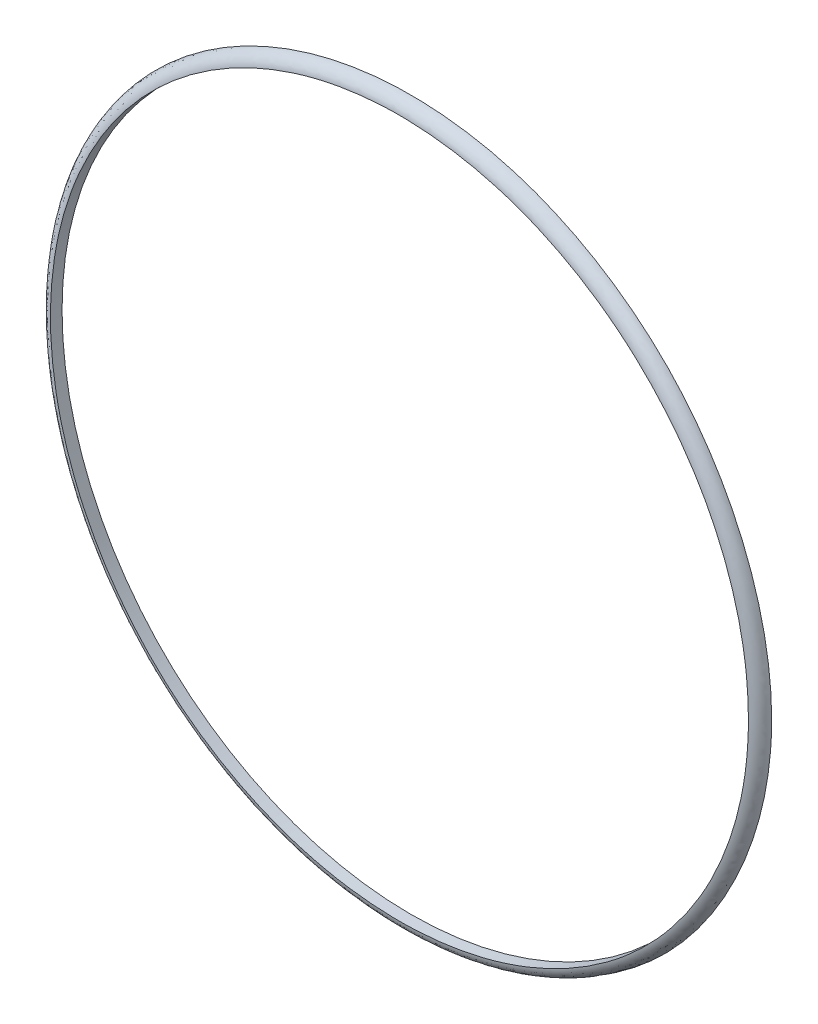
ISO-10303-21;
HEADER;
FILE_DESCRIPTION(('STEP AP214'),'2;1');
FILE_NAME('part.step','',(''),(''),'','','');
FILE_SCHEMA(('AUTOMOTIVE_DESIGN { 1 0 10303 214 1 1 1 1 }'));
ENDSEC;
DATA;
#1=APPLICATION_CONTEXT('core data for automotive mechanical design processes');
#2=APPLICATION_PROTOCOL_DEFINITION('international standard','automotive_design',2000,#1);
#3=PRODUCT_CONTEXT('',#1,'mechanical');
#4=PRODUCT('Part','Part','',(#3));
#5=PRODUCT_RELATED_PRODUCT_CATEGORY('part','',(#4));
#6=PRODUCT_DEFINITION_FORMATION('','',#4);
#7=PRODUCT_DEFINITION_CONTEXT('part definition',#1,'design');
#8=PRODUCT_DEFINITION('design','',#6,#7);
#9=PRODUCT_DEFINITION_SHAPE('','',#8);
#10=(LENGTH_UNIT() NAMED_UNIT(*) SI_UNIT(.MILLI.,.METRE.));
#11=(NAMED_UNIT(*) PLANE_ANGLE_UNIT() SI_UNIT($,.RADIAN.));
#12=(NAMED_UNIT(*) SI_UNIT($,.STERADIAN.) SOLID_ANGLE_UNIT());
#13=UNCERTAINTY_MEASURE_WITH_UNIT(LENGTH_MEASURE(1.E-05),#10,'distance_accuracy_value','');
#14=(GEOMETRIC_REPRESENTATION_CONTEXT(3) GLOBAL_UNCERTAINTY_ASSIGNED_CONTEXT((#13)) GLOBAL_UNIT_ASSIGNED_CONTEXT((#10,
#11,#12)) REPRESENTATION_CONTEXT('',''));
#15=CARTESIAN_POINT('',(0.,0.,0.));
#16=DIRECTION('',(0.,0.,1.));
#17=DIRECTION('',(1.,0.,0.));
#18=AXIS2_PLACEMENT_3D('',#15,#16,#17);
#19=CARTESIAN_POINT('',(290.400597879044,-223.557829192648,-7.28949133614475));
#20=DIRECTION('',(0.,0.,-1.));
#21=DIRECTION('',(1.,0.,0.));
#22=AXIS2_PLACEMENT_3D('',#19,#20,#21);
#23=CYLINDRICAL_SURFACE('',#22,30.);
#24=CARTESIAN_POINT('',(320.400597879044,-223.557829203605,-56.2894913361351));
#25=CARTESIAN_POINT('',(320.400597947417,-223.931991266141,-56.2894914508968));
#26=CARTESIAN_POINT('',(320.393596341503,-224.306142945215,-56.2895552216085));
#27=CARTESIAN_POINT('',(320.365602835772,-225.054025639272,-56.2897862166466));
#28=CARTESIAN_POINT('',(320.344606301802,-225.427756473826,-56.2899534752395));
#29=CARTESIAN_POINT('',(320.259899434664,-226.557330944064,-56.2905890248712));
#30=CARTESIAN_POINT('',(320.17446738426,-227.311709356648,-56.2911900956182));
#31=CARTESIAN_POINT('',(320.003653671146,-228.436682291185,-56.2922319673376));
#32=CARTESIAN_POINT('',(319.939582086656,-228.81067283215,-56.292602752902));
#33=CARTESIAN_POINT('',(319.797289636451,-229.556034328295,-56.2933651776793));
#34=CARTESIAN_POINT('',(319.71906614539,-229.927404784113,-56.293756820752));
#35=CARTESIAN_POINT('',(319.463099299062,-231.037693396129,-56.294921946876));
#36=CARTESIAN_POINT('',(319.264203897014,-231.771838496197,-56.2956846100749));
#37=CARTESIAN_POINT('',(318.811228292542,-233.222909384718,-56.2969473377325));
#38=CARTESIAN_POINT('',(318.557147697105,-233.939835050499,-56.2974474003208));
#39=CARTESIAN_POINT('',(318.135911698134,-234.998837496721,-56.2978791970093));
#40=CARTESIAN_POINT('',(317.988856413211,-235.349020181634,-56.297970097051));
#41=CARTESIAN_POINT('',(317.681593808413,-236.043477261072,-56.298039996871));
#42=CARTESIAN_POINT('',(317.521389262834,-236.387752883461,-56.2980190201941));
#43=CARTESIAN_POINT('',(317.021308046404,-237.411138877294,-56.2977868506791));
#44=CARTESIAN_POINT('',(316.661946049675,-238.080852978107,-56.2974064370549));
#45=CARTESIAN_POINT('',(315.893566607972,-239.390870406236,-56.2963134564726));
#46=CARTESIAN_POINT('',(315.484560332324,-240.031180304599,-56.2956009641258));
#47=CARTESIAN_POINT('',(314.61913514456,-241.278973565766,-56.2940748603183));
#48=CARTESIAN_POINT('',(314.162713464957,-241.886455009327,-56.2932612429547));
#49=CARTESIAN_POINT('',(313.152159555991,-243.130190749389,-56.291686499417));
#50=CARTESIAN_POINT('',(312.592803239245,-243.762210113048,-56.290941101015));
#51=CARTESIAN_POINT('',(311.422816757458,-244.976921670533,-56.2899353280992));
#52=CARTESIAN_POINT('',(310.812182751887,-245.559610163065,-56.2896749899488));
#53=CARTESIAN_POINT('',(309.54379054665,-246.67167271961,-56.2894900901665));
#54=CARTESIAN_POINT('',(308.886016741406,-247.201028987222,-56.28956564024));
#55=CARTESIAN_POINT('',(307.528219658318,-248.202426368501,-56.2896917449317));
#56=CARTESIAN_POINT('',(306.828197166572,-248.674468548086,-56.2897423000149));
#57=CARTESIAN_POINT('',(305.390964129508,-249.557835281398,-56.2896622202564));
#58=CARTESIAN_POINT('',(304.653758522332,-249.969167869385,-56.289531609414));
#59=CARTESIAN_POINT('',(303.147312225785,-250.728266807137,-56.2892290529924));
#60=CARTESIAN_POINT('',(302.378071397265,-251.076032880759,-56.2890571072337));
#61=CARTESIAN_POINT('',(300.813081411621,-251.705502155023,-56.2888007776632));
#62=CARTESIAN_POINT('',(300.017334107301,-251.987209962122,-56.2887163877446));
#63=CARTESIAN_POINT('',(298.404937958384,-252.482590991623,-56.2887120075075));
#64=CARTESIAN_POINT('',(297.588289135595,-252.69626428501,-56.2887920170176));
#65=CARTESIAN_POINT('',(295.939866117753,-253.054063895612,-56.289053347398));
#66=CARTESIAN_POINT('',(295.108091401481,-253.198187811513,-56.2892346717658));
#67=CARTESIAN_POINT('',(293.435357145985,-253.415853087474,-56.2894513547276));
#68=CARTESIAN_POINT('',(292.594397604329,-253.489394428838,-56.2894867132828));
#69=CARTESIAN_POINT('',(290.909265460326,-253.565371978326,-56.2895163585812));
#70=CARTESIAN_POINT('',(290.065092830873,-253.567807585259,-56.2895106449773));
#71=CARTESIAN_POINT('',(288.379543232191,-253.501554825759,-56.2894779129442));
#72=CARTESIAN_POINT('',(287.538166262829,-253.432866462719,-56.289450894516));
#73=CARTESIAN_POINT('',(285.864193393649,-253.224854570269,-56.2892501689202));
#74=CARTESIAN_POINT('',(285.031597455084,-253.085531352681,-56.2890764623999));
#75=CARTESIAN_POINT('',(283.381102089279,-252.737240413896,-56.2888280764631));
#76=CARTESIAN_POINT('',(282.563202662,-252.528272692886,-56.2887533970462));
#77=CARTESIAN_POINT('',(280.947914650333,-252.042178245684,-56.2887540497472));
#78=CARTESIAN_POINT('',(280.150526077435,-251.765051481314,-56.2888293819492));
#79=CARTESIAN_POINT('',(278.581929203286,-251.144609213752,-56.2890239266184));
#80=CARTESIAN_POINT('',(277.810720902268,-250.801293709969,-56.2891431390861));
#81=CARTESIAN_POINT('',(276.299967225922,-250.050914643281,-56.2893622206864));
#82=CARTESIAN_POINT('',(275.560421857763,-249.643851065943,-56.2894620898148));
#83=CARTESIAN_POINT('',(274.118251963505,-248.768869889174,-56.2896555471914));
#84=CARTESIAN_POINT('',(273.4156274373,-248.300952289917,-56.2897491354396));
#85=CARTESIAN_POINT('',(272.052295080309,-247.307590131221,-56.2899239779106));
#86=CARTESIAN_POINT('',(271.391587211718,-246.782145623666,-56.2900052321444));
#87=CARTESIAN_POINT('',(270.116784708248,-245.677464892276,-56.2901128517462));
#88=CARTESIAN_POINT('',(269.502690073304,-245.098228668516,-56.2901392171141));
#89=CARTESIAN_POINT('',(268.325479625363,-243.890082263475,-56.2901182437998));
#90=CARTESIAN_POINT('',(267.762363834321,-243.261172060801,-56.2900709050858));
#91=CARTESIAN_POINT('',(266.691114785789,-241.958149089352,-56.2899339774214));
#92=CARTESIAN_POINT('',(266.1829815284,-241.284036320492,-56.2898443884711));
#93=CARTESIAN_POINT('',(265.225309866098,-239.895400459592,-56.2896614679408));
#94=CARTESIAN_POINT('',(264.775771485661,-239.180877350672,-56.2895681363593));
#95=CARTESIAN_POINT('',(263.938485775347,-237.716500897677,-56.2893697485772));
#96=CARTESIAN_POINT('',(263.550738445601,-236.966647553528,-56.2892646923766));
#97=CARTESIAN_POINT('',(262.839791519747,-235.436941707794,-56.2890396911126));
#98=CARTESIAN_POINT('',(262.516591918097,-234.657089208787,-56.2889197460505));
#99=CARTESIAN_POINT('',(261.937038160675,-233.07292926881,-56.2887636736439));
#100=CARTESIAN_POINT('',(261.680684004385,-232.268621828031,-56.2887275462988));
#101=CARTESIAN_POINT('',(261.23664370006,-230.641270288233,-56.2888170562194));
#102=CARTESIAN_POINT('',(261.048957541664,-229.818226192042,-56.2889426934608));
#103=CARTESIAN_POINT('',(260.743587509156,-228.159252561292,-56.2892165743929));
#104=CARTESIAN_POINT('',(260.625903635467,-227.323323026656,-56.2893648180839));
#105=CARTESIAN_POINT('',(260.461374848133,-225.644521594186,-56.289500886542));
#106=CARTESIAN_POINT('',(260.414529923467,-224.801649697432,-56.2894887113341));
#107=CARTESIAN_POINT('',(260.392012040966,-223.11495573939,-56.2894972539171));
#108=CARTESIAN_POINT('',(260.416339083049,-222.271133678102,-56.289517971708));
#109=CARTESIAN_POINT('',(260.535992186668,-220.588538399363,-56.2894422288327));
#110=CARTESIAN_POINT('',(260.631318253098,-219.749765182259,-56.2893457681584));
#111=CARTESIAN_POINT('',(260.892291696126,-218.083230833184,-56.2890849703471));
#112=CARTESIAN_POINT('',(261.057939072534,-217.255469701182,-56.2889206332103));
#113=CARTESIAN_POINT('',(261.458377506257,-215.616844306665,-56.2887441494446));
#114=CARTESIAN_POINT('',(261.693168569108,-214.805980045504,-56.2887320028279));
#115=CARTESIAN_POINT('',(262.230225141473,-213.206913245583,-56.2888286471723));
#116=CARTESIAN_POINT('',(262.5324906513,-212.418710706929,-56.288937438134));
#117=CARTESIAN_POINT('',(263.202347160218,-210.87057106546,-56.2891576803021));
#118=CARTESIAN_POINT('',(263.569938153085,-210.110633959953,-56.2892691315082));
#119=CARTESIAN_POINT('',(264.367832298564,-208.624427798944,-56.289475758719));
#120=CARTESIAN_POINT('',(264.798135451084,-207.898158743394,-56.2895709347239));
#121=CARTESIAN_POINT('',(265.718394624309,-206.484452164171,-56.2897593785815));
#122=CARTESIAN_POINT('',(266.208350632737,-205.797014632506,-56.2898526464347));
#123=CARTESIAN_POINT('',(267.244432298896,-204.465858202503,-56.290011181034));
#124=CARTESIAN_POINT('',(267.790557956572,-203.822139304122,-56.29007644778));
#125=CARTESIAN_POINT('',(268.935096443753,-202.582996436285,-56.2901394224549));
#126=CARTESIAN_POINT('',(269.533509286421,-201.987572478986,-56.2901371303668));
#127=CARTESIAN_POINT('',(270.778367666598,-200.849252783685,-56.2900666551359));
#128=CARTESIAN_POINT('',(271.424813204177,-200.306357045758,-56.2899984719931));
#129=CARTESIAN_POINT('',(272.761141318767,-199.276953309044,-56.2898367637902));
#130=CARTESIAN_POINT('',(273.451023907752,-198.790445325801,-56.289743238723));
#131=CARTESIAN_POINT('',(274.869321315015,-197.877276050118,-56.2895538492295));
#132=CARTESIAN_POINT('',(275.597736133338,-197.450614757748,-56.2894579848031));
#133=CARTESIAN_POINT('',(277.087918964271,-196.660172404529,-56.2892494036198));
#134=CARTESIAN_POINT('',(277.849686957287,-196.296391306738,-56.2891366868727));
#135=CARTESIAN_POINT('',(279.401160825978,-195.634295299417,-56.2889192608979));
#136=CARTESIAN_POINT('',(280.190866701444,-195.335980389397,-56.2888145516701));
#137=CARTESIAN_POINT('',(281.792602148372,-194.806937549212,-56.2887317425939));
#138=CARTESIAN_POINT('',(282.604631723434,-194.576209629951,-56.2887536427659));
#139=CARTESIAN_POINT('',(284.245241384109,-194.183981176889,-56.2889435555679));
#140=CARTESIAN_POINT('',(285.073821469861,-194.02248064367,-56.289111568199));
#141=CARTESIAN_POINT('',(286.741641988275,-193.769855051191,-56.2893639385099));
#142=CARTESIAN_POINT('',(287.580882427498,-193.678730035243,-56.289448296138));
#143=CARTESIAN_POINT('',(289.264056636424,-193.567503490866,-56.289515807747));
#144=CARTESIAN_POINT('',(290.107990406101,-193.547401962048,-56.2894989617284));
#145=CARTESIAN_POINT('',(291.794549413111,-193.578365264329,-56.2894930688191));
#146=CARTESIAN_POINT('',(292.637174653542,-193.629429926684,-56.2895040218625));
#147=CARTESIAN_POINT('',(294.315128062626,-193.802362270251,-56.2893587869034));
#148=CARTESIAN_POINT('',(295.150456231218,-193.924229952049,-56.2892025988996));
#149=CARTESIAN_POINT('',(296.807880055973,-194.237902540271,-56.2889148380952));
#150=CARTESIAN_POINT('',(297.629975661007,-194.42970771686,-56.2887832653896));
#151=CARTESIAN_POINT('',(299.255086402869,-194.881891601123,-56.2886870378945));
#152=CARTESIAN_POINT('',(300.058101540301,-195.142270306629,-56.2887223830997));
#153=CARTESIAN_POINT('',(301.639354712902,-195.729754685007,-56.28891736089));
#154=CARTESIAN_POINT('',(302.417592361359,-196.056861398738,-56.2890769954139));
#155=CARTESIAN_POINT('',(303.943744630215,-196.775473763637,-56.2893920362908));
#156=CARTESIAN_POINT('',(304.691659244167,-197.166979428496,-56.2895474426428));
#157=CARTESIAN_POINT('',(306.151822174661,-198.011591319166,-56.2897212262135));
#158=CARTESIAN_POINT('',(306.864071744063,-198.464695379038,-56.289739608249));
#159=CARTESIAN_POINT('',(308.247868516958,-199.429292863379,-56.2896466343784));
#160=CARTESIAN_POINT('',(308.919415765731,-199.940786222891,-56.2895352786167));
#161=CARTESIAN_POINT('',(310.216981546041,-201.01848233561,-56.2895403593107));
#162=CARTESIAN_POINT('',(310.843003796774,-201.584680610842,-56.2896567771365));
#163=CARTESIAN_POINT('',(312.045132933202,-202.767799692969,-56.2903890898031));
#164=CARTESIAN_POINT('',(312.621239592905,-203.384720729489,-56.2910049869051));
#165=CARTESIAN_POINT('',(313.71955150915,-204.665028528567,-56.292515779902));
#166=CARTESIAN_POINT('',(314.241745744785,-205.328424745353,-56.2934107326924));
#167=CARTESIAN_POINT('',(315.22837638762,-206.696841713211,-56.2951464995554));
#168=CARTESIAN_POINT('',(315.692813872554,-207.401861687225,-56.295987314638));
#169=CARTESIAN_POINT('',(316.560776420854,-208.848750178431,-56.2972903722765));
#170=CARTESIAN_POINT('',(316.96428226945,-209.59063022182,-56.2977524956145));
#171=CARTESIAN_POINT('',(317.707365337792,-211.105822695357,-56.2981128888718));
#172=CARTESIAN_POINT('',(318.046937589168,-211.879137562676,-56.2980111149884));
#173=CARTESIAN_POINT('',(318.659455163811,-213.450999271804,-56.2972902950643));
#174=CARTESIAN_POINT('',(318.932452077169,-214.249526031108,-56.2966716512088));
#175=CARTESIAN_POINT('',(319.410164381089,-215.866576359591,-56.2951661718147));
#176=CARTESIAN_POINT('',(319.614900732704,-216.685093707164,-56.2942794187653));
#177=CARTESIAN_POINT('',(319.887169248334,-218.008033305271,-56.2929014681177));
#178=CARTESIAN_POINT('',(319.976892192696,-218.508000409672,-56.2923931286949));
#179=CARTESIAN_POINT('',(320.130842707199,-219.511811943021,-56.291458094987));
#180=CARTESIAN_POINT('',(320.195073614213,-220.015655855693,-56.2910313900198));
#181=CARTESIAN_POINT('',(320.297809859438,-221.02526648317,-56.2903114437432));
#182=CARTESIAN_POINT('',(320.336349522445,-221.531029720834,-56.2900180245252));
#183=CARTESIAN_POINT('',(320.387741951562,-222.543811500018,-56.2896079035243));
#184=CARTESIAN_POINT('',(320.400597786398,-223.050829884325,-56.28949118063));
#185=CARTESIAN_POINT('',(320.400597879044,-223.557829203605,-56.2894913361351));
#186=B_SPLINE_CURVE_WITH_KNOTS('',3,(#24,#25,#26,#27,#28,#29,#30,#31,#32,#33,#34,#35,#36,#37,
#38,#39,#40,#41,#42,#43,#44,#45,#46,#47,#48,#49,#50,#51,#52,#53,#54,#55,#56,#57,#58,#59,#60,#61,
#62,#63,#64,#65,#66,#67,#68,#69,#70,#71,#72,#73,#74,#75,#76,#77,#78,#79,#80,#81,#82,#83,#84,#85,
#86,#87,#88,#89,#90,#91,#92,#93,#94,#95,#96,#97,#98,#99,#100,#101,#102,#103,#104,#105,#106,#107,
#108,#109,#110,#111,#112,#113,#114,#115,#116,#117,#118,#119,#120,#121,#122,#123,#124,#125,#126,
#127,#128,#129,#130,#131,#132,#133,#134,#135,#136,#137,#138,#139,#140,#141,#142,#143,#144,#145,
#146,#147,#148,#149,#150,#151,#152,#153,#154,#155,#156,#157,#158,#159,#160,#161,#162,#163,#164,
#165,#166,#167,#168,#169,#170,#171,#172,#173,#174,#175,#176,#177,#178,#179,#180,#181,#182,#183,
#184,#185),.UNSPECIFIED.,.T.,.F.,(4,2,2,2,2,2,2,2,2,2,2,2,2,2,2,2,2,2,2,2,2,2,2,2,2,2,2,2,2,2,2,
2,2,2,2,2,2,2,2,2,2,2,2,2,2,2,2,2,2,2,2,2,2,2,2,2,2,2,2,2,2,2,2,2,2,2,2,2,2,2,2,2,2,2,2,2,2,2,2,
2,4),(0.,1.12238956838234,2.24515097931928,4.52014412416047,5.65824677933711,6.79656078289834,
9.07606475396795,11.3555849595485,12.4947648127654,13.633704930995,15.9114415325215,
18.1886666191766,20.4660246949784,22.9949624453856,25.5240897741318,28.0540582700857,
30.5839797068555,33.1135660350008,35.6431633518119,38.1725842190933,40.7020024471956,
43.2315080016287,45.761014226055,48.2905418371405,50.8200693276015,53.3495856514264,
55.8791019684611,58.4086197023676,60.9381374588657,63.4676557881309,65.9971741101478,
68.52669015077,71.0562061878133,73.5857233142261,76.1152404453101,78.6447586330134,
81.174276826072,83.7037948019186,86.2333127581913,88.7628303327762,91.2923479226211,
93.8218651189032,96.3513823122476,98.8808996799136,101.410417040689,103.93993460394,
106.469452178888,108.998969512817,111.528486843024,114.058003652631,116.587520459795,
119.117037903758,121.646555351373,124.176073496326,126.705591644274,129.235108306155,
131.764624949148,134.294142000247,136.823659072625,139.353177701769,141.882696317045,
144.412208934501,146.941721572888,149.471243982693,152.000766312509,154.530328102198,
157.059890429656,159.589363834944,162.1188344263,164.648098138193,167.177373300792,
169.707164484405,172.236908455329,174.767448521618,177.298185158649,179.82695441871,
182.35494644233,183.878233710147,185.401321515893,186.922370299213,188.443237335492),.UNSPECIFIED.);
#187=CARTESIAN_POINT('',(320.400597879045,-223.557829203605,-56.2894913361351));
#188=VERTEX_POINT('',#187);
#189=EDGE_CURVE('E391',#188,#188,#186,.T.);
#190=ORIENTED_EDGE('',*,*,#189,.F.);
#191=EDGE_LOOP('',(#190));
#192=FACE_BOUND('',#191,.T.);
#193=CARTESIAN_POINT('',(290.400597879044,-223.557829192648,-57.2894913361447));
#194=DIRECTION('',(0.,0.,1.));
#195=DIRECTION('',(-1.,0.,0.));
#196=AXIS2_PLACEMENT_3D('',#193,#194,#195);
#197=CIRCLE('',#196,30.);
#198=CARTESIAN_POINT('',(260.400597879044,-223.557829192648,-57.2894913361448));
#199=VERTEX_POINT('',#198);
#200=EDGE_CURVE('E401',#199,#199,#197,.T.);
#201=ORIENTED_EDGE('',*,*,#200,.F.);
#202=EDGE_LOOP('',(#201));
#203=FACE_BOUND('',#202,.T.);
#204=ADVANCED_FACE('F384',(#192,#203),#23,.F.);
#205=CARTESIAN_POINT('',(125.400597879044,-298.557829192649,-57.289491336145));
#206=DIRECTION('',(0.,0.,1.));
#207=DIRECTION('',(0.,1.,0.));
#208=AXIS2_PLACEMENT_3D('',#205,#206,#207);
#209=PLANE('',#208);
#210=CARTESIAN_POINT('',(321.400597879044,-223.557829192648,-57.2894913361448));
#211=CARTESIAN_POINT('',(321.400598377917,-223.183609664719,-57.2894913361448));
#212=CARTESIAN_POINT('',(321.393234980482,-222.809409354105,-57.2894913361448));
#213=CARTESIAN_POINT('',(321.364051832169,-222.061515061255,-57.2894913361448));
#214=CARTESIAN_POINT('',(321.3422293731,-221.687821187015,-57.2894913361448));
#215=CARTESIAN_POINT('',(321.254775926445,-220.559329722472,-57.2894913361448));
#216=CARTESIAN_POINT('',(321.16716751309,-219.806128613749,-57.2894913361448));
#217=CARTESIAN_POINT('',(320.936098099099,-218.308098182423,-57.2894913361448));
#218=CARTESIAN_POINT('',(320.792609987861,-217.563273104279,-57.2894913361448));
#219=CARTESIAN_POINT('',(320.451679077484,-216.084444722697,-57.2894913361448));
#220=CARTESIAN_POINT('',(320.254123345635,-215.350467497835,-57.2894913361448));
#221=CARTESIAN_POINT('',(319.807289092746,-213.8985045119,-57.2894913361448));
#222=CARTESIAN_POINT('',(319.558016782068,-213.18051684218,-57.2894913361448));
#223=CARTESIAN_POINT('',(319.101421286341,-212.000986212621,-57.2894913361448));
#224=CARTESIAN_POINT('',(318.907968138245,-211.534017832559,-57.2894913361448));
#225=CARTESIAN_POINT('',(318.499474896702,-210.609588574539,-57.2894913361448));
#226=CARTESIAN_POINT('',(318.284434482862,-210.152127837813,-57.2894913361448));
#227=CARTESIAN_POINT('',(317.833233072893,-209.24775255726,-57.2894913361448));
#228=CARTESIAN_POINT('',(317.597072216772,-208.800837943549,-57.2894913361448));
#229=CARTESIAN_POINT('',(317.104250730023,-207.918951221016,-57.2894913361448));
#230=CARTESIAN_POINT('',(316.84760764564,-207.483969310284,-57.2894913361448));
#231=CARTESIAN_POINT('',(316.314025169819,-206.626617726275,-57.2894913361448));
#232=CARTESIAN_POINT('',(316.03708534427,-206.20424832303,-57.2894913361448));
#233=CARTESIAN_POINT('',(315.463240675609,-205.373204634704,-57.2894913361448));
#234=CARTESIAN_POINT('',(315.166332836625,-204.964532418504,-57.2894913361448));
#235=CARTESIAN_POINT('',(314.493496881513,-204.084386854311,-57.2894913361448));
#236=CARTESIAN_POINT('',(314.113404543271,-203.616087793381,-57.2894913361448));
#237=CARTESIAN_POINT('',(313.325895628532,-202.702920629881,-57.2894913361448));
#238=CARTESIAN_POINT('',(312.918476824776,-202.258054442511,-57.2894913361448));
#239=CARTESIAN_POINT('',(312.287454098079,-201.610263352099,-57.2894913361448));
#240=CARTESIAN_POINT('',(312.073794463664,-201.397581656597,-57.2894913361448));
#241=CARTESIAN_POINT('',(311.640030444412,-200.978900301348,-57.2894913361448));
#242=CARTESIAN_POINT('',(311.419926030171,-200.772900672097,-57.2894913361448));
#243=CARTESIAN_POINT('',(310.750000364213,-200.1648138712,-57.2894913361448));
#244=CARTESIAN_POINT('',(310.29083236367,-199.772911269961,-57.2894913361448));
#245=CARTESIAN_POINT('',(309.585238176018,-199.206180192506,-57.2894913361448));
#246=CARTESIAN_POINT('',(309.347202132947,-199.020768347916,-57.2894913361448));
#247=CARTESIAN_POINT('',(308.86577146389,-198.657018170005,-57.2894913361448));
#248=CARTESIAN_POINT('',(308.622376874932,-198.478679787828,-57.2894913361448));
#249=CARTESIAN_POINT('',(308.130516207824,-198.129114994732,-57.2894913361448));
#250=CARTESIAN_POINT('',(307.882049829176,-197.95788900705,-57.2894913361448));
#251=CARTESIAN_POINT('',(307.380332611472,-197.622585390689,-57.2894913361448));
#252=CARTESIAN_POINT('',(307.127081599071,-197.458508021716,-57.2894913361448));
#253=CARTESIAN_POINT('',(306.510327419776,-197.071341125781,-57.2894913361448));
#254=CARTESIAN_POINT('',(306.144524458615,-196.851895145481,-57.2894913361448));
#255=CARTESIAN_POINT('',(305.404327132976,-196.428060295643,-57.2894913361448));
#256=CARTESIAN_POINT('',(305.029932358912,-196.223672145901,-57.2894913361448));
#257=CARTESIAN_POINT('',(303.894804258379,-195.633832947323,-57.2894913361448));
#258=CARTESIAN_POINT('',(303.121799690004,-195.271501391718,-57.2894913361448));
#259=CARTESIAN_POINT('',(301.942163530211,-194.777311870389,-57.2894913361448));
#260=CARTESIAN_POINT('',(301.545627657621,-194.620810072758,-57.2894913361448));
#261=CARTESIAN_POINT('',(300.746309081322,-194.324543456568,-57.2894913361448));
#262=CARTESIAN_POINT('',(300.343526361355,-194.184778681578,-57.2894913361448));
#263=CARTESIAN_POINT('',(299.532416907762,-193.922305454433,-57.2894913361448));
#264=CARTESIAN_POINT('',(299.124089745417,-193.799598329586,-57.2894913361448));
#265=CARTESIAN_POINT('',(298.302637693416,-193.571456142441,-57.2894913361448));
#266=CARTESIAN_POINT('',(297.889512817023,-193.466021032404,-57.2894913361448));
#267=CARTESIAN_POINT('',(297.052132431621,-193.270908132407,-57.2894913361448));
#268=CARTESIAN_POINT('',(296.627807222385,-193.181529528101,-57.2894913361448));
#269=CARTESIAN_POINT('',(295.775769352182,-193.020709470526,-57.2894913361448));
#270=CARTESIAN_POINT('',(295.348056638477,-192.949268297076,-57.2894913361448));
#271=CARTESIAN_POINT('',(294.490037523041,-192.824158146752,-57.2894913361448));
#272=CARTESIAN_POINT('',(294.059731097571,-192.770489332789,-57.2894913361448));
#273=CARTESIAN_POINT('',(293.19727888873,-192.680936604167,-57.2894913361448));
#274=CARTESIAN_POINT('',(292.765133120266,-192.645052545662,-57.2894913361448));
#275=CARTESIAN_POINT('',(291.899548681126,-192.591184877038,-57.2894913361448));
#276=CARTESIAN_POINT('',(291.466109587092,-192.573207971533,-57.2894913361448));
#277=CARTESIAN_POINT('',(290.815695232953,-192.559879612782,-57.2894913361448));
#278=CARTESIAN_POINT('',(290.598841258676,-192.557709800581,-57.2894913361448));
#279=CARTESIAN_POINT('',(290.16513590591,-192.557958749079,-57.2894913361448));
#280=CARTESIAN_POINT('',(289.948284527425,-192.560377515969,-57.2894913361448));
#281=CARTESIAN_POINT('',(289.297865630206,-192.574450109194,-57.2894913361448));
#282=CARTESIAN_POINT('',(288.864425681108,-192.59292007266,-57.2894913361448));
#283=CARTESIAN_POINT('',(287.99872839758,-192.64779119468,-57.2894913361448));
#284=CARTESIAN_POINT('',(287.566471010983,-192.684191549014,-57.2894913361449));
#285=CARTESIAN_POINT('',(286.553252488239,-192.790607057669,-57.2894913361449));
#286=CARTESIAN_POINT('',(285.973040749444,-192.867920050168,-57.2894913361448));
#287=CARTESIAN_POINT('',(284.817897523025,-193.055045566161,-57.2894913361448));
#288=CARTESIAN_POINT('',(284.242965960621,-193.164857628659,-57.2894913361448));
#289=CARTESIAN_POINT('',(283.100384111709,-193.417348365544,-57.2894913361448));
#290=CARTESIAN_POINT('',(282.532733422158,-193.560025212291,-57.2894913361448));
#291=CARTESIAN_POINT('',(281.406782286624,-193.877791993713,-57.2894913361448));
#292=CARTESIAN_POINT('',(280.848478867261,-194.052871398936,-57.2894913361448));
#293=CARTESIAN_POINT('',(279.742811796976,-194.434816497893,-57.2894913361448));
#294=CARTESIAN_POINT('',(279.195448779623,-194.641684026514,-57.2894913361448));
#295=CARTESIAN_POINT('',(278.113367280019,-195.086129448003,-57.2894913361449));
#296=CARTESIAN_POINT('',(277.578649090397,-195.323708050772,-57.2894913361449));
#297=CARTESIAN_POINT('',(276.26999679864,-195.950029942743,-57.2894913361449));
#298=CARTESIAN_POINT('',(275.504496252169,-196.356577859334,-57.2894913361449));
#299=CARTESIAN_POINT('',(274.010277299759,-197.232139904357,-57.2894913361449));
#300=CARTESIAN_POINT('',(273.281556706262,-197.701150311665,-57.2894913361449));
#301=CARTESIAN_POINT('',(271.865556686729,-198.698711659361,-57.2894913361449));
#302=CARTESIAN_POINT('',(271.178291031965,-199.227282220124,-57.2894913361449));
#303=CARTESIAN_POINT('',(270.182366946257,-200.061480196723,-57.2894913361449));
#304=CARTESIAN_POINT('',(269.856200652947,-200.346457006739,-57.2894913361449));
#305=CARTESIAN_POINT('',(269.215911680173,-200.929800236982,-57.2894913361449));
#306=CARTESIAN_POINT('',(268.901792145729,-201.22817011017,-57.2894913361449));
#307=CARTESIAN_POINT('',(267.972593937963,-202.148249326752,-57.2894913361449));
#308=CARTESIAN_POINT('',(267.376884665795,-202.789728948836,-57.2894913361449));
#309=CARTESIAN_POINT('',(266.241482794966,-204.120474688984,-57.2894913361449));
#310=CARTESIAN_POINT('',(265.701789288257,-204.809740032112,-57.2894913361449));
#311=CARTESIAN_POINT('',(264.937458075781,-205.875722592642,-57.2894913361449));
#312=CARTESIAN_POINT('',(264.690212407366,-206.23640330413,-57.2894913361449));
#313=CARTESIAN_POINT('',(264.211245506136,-206.96779705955,-57.2894913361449));
#314=CARTESIAN_POINT('',(263.979520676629,-207.338507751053,-57.2894913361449));
#315=CARTESIAN_POINT('',(263.308067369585,-208.464959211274,-57.2894913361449));
#316=CARTESIAN_POINT('',(262.89203079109,-209.235060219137,-57.2894913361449));
#317=CARTESIAN_POINT('',(262.253918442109,-210.545737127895,-57.2894913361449));
#318=CARTESIAN_POINT('',(262.013357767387,-211.07745095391,-57.2894913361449));
#319=CARTESIAN_POINT('',(261.562653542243,-212.153661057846,-57.2894913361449));
#320=CARTESIAN_POINT('',(261.352509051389,-212.698156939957,-57.2894913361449));
#321=CARTESIAN_POINT('',(260.963740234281,-213.798238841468,-57.2894913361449));
#322=CARTESIAN_POINT('',(260.785113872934,-214.353824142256,-57.2894913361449));
#323=CARTESIAN_POINT('',(260.460025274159,-215.474486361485,-57.2894913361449));
#324=CARTESIAN_POINT('',(260.313571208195,-216.039565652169,-57.2894913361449));
#325=CARTESIAN_POINT('',(260.053341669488,-217.177218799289,-57.2894913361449));
#326=CARTESIAN_POINT('',(259.939567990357,-217.749793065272,-57.2894913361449));
#327=CARTESIAN_POINT('',(259.744410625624,-218.900452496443,-57.2894913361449));
#328=CARTESIAN_POINT('',(259.663027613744,-219.478537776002,-57.2894913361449));
#329=CARTESIAN_POINT('',(259.549335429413,-220.488438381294,-57.2894913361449));
#330=CARTESIAN_POINT('',(259.509779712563,-220.919453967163,-57.2894913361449));
#331=CARTESIAN_POINT('',(259.448473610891,-221.782782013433,-57.2894913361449));
#332=CARTESIAN_POINT('',(259.42672406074,-222.215094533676,-57.2894913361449));
#333=CARTESIAN_POINT('',(259.401294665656,-223.080236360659,-57.2894913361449));
#334=CARTESIAN_POINT('',(259.397614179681,-223.513065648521,-57.2894913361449));
#335=CARTESIAN_POINT('',(259.408465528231,-224.37849059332,-57.2894913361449));
#336=CARTESIAN_POINT('',(259.422997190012,-224.811086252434,-57.2894913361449));
#337=CARTESIAN_POINT('',(259.469927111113,-225.675224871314,-57.2894913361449));
#338=CARTESIAN_POINT('',(259.502322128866,-226.10676800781,-57.2894913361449));
#339=CARTESIAN_POINT('',(259.584855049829,-226.968159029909,-57.2894913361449));
#340=CARTESIAN_POINT('',(259.63499313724,-227.398006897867,-57.2894913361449));
#341=CARTESIAN_POINT('',(259.752979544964,-228.255258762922,-57.2894913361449));
#342=CARTESIAN_POINT('',(259.820827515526,-228.682662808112,-57.2894913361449));
#343=CARTESIAN_POINT('',(259.974377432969,-229.534250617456,-57.2894913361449));
#344=CARTESIAN_POINT('',(260.060079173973,-229.958434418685,-57.2894913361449));
#345=CARTESIAN_POINT('',(260.250837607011,-230.808968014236,-57.2894913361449));
#346=CARTESIAN_POINT('',(260.356159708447,-231.235258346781,-57.2894913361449));
#347=CARTESIAN_POINT('',(260.585133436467,-232.082887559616,-57.2894913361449));
#348=CARTESIAN_POINT('',(260.708785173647,-232.504226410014,-57.2894913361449));
#349=CARTESIAN_POINT('',(260.974181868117,-233.341190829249,-57.2894913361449));
#350=CARTESIAN_POINT('',(261.115927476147,-233.756816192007,-57.2894913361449));
#351=CARTESIAN_POINT('',(261.417143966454,-234.581562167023,-57.2894913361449));
#352=CARTESIAN_POINT('',(261.576614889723,-234.990682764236,-57.2894913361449));
#353=CARTESIAN_POINT('',(262.08092911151,-236.207284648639,-57.2894913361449));
#354=CARTESIAN_POINT('',(262.451726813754,-237.004172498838,-57.2894913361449));
#355=CARTESIAN_POINT('',(263.259492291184,-238.563645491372,-57.2894913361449));
#356=CARTESIAN_POINT('',(263.696458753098,-239.326231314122,-57.2894913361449));
#357=CARTESIAN_POINT('',(264.395695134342,-240.434754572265,-57.2894913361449));
#358=CARTESIAN_POINT('',(264.63418373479,-240.795870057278,-57.2894913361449));
#359=CARTESIAN_POINT('',(265.126054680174,-241.507810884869,-57.2894913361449));
#360=CARTESIAN_POINT('',(265.379437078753,-241.858636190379,-57.2894913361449));
#361=CARTESIAN_POINT('',(266.161203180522,-242.894751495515,-57.2894913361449));
#362=CARTESIAN_POINT('',(266.711308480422,-243.563843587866,-57.2894913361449));
#363=CARTESIAN_POINT('',(267.865154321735,-244.854021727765,-57.2894913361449));
#364=CARTESIAN_POINT('',(268.468900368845,-245.475102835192,-57.2894913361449));
#365=CARTESIAN_POINT('',(269.725827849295,-246.665081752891,-57.2894913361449));
#366=CARTESIAN_POINT('',(270.379008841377,-247.233980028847,-57.2894913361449));
#367=CARTESIAN_POINT('',(271.739066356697,-248.322268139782,-57.2894913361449));
#368=CARTESIAN_POINT('',(272.446519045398,-248.840938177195,-57.2894913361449));
#369=CARTESIAN_POINT('',(273.902844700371,-249.816540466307,-57.2894913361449));
#370=CARTESIAN_POINT('',(274.651719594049,-250.273469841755,-57.2894913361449));
#371=CARTESIAN_POINT('',(276.185209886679,-251.122266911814,-57.2894913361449));
#372=CARTESIAN_POINT('',(276.969817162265,-251.514149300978,-57.2894913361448));
#373=CARTESIAN_POINT('',(278.569462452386,-252.230131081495,-57.2894913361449));
#374=CARTESIAN_POINT('',(279.384498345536,-252.554235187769,-57.2894913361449));
#375=CARTESIAN_POINT('',(280.623193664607,-252.986167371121,-57.2894913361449));
#376=CARTESIAN_POINT('',(281.037673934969,-253.120824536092,-57.2894913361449));
#377=CARTESIAN_POINT('',(281.872018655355,-253.372229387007,-57.2894913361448));
#378=CARTESIAN_POINT('',(282.291882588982,-253.488978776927,-57.2894913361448));
#379=CARTESIAN_POINT('',(283.136264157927,-253.704372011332,-57.2894913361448));
#380=CARTESIAN_POINT('',(283.560782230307,-253.803014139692,-57.2894913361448));
#381=CARTESIAN_POINT('',(284.413642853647,-253.982074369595,-57.2894913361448));
#382=CARTESIAN_POINT('',(284.841985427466,-254.062492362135,-57.2894913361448));
#383=CARTESIAN_POINT('',(285.701740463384,-254.205305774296,-57.2894913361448));
#384=CARTESIAN_POINT('',(286.133153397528,-254.26769835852,-57.2894913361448));
#385=CARTESIAN_POINT('',(286.998157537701,-254.374509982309,-57.2894913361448));
#386=CARTESIAN_POINT('',(287.4317487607,-254.418928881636,-57.2894913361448));
#387=CARTESIAN_POINT('',(288.734754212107,-254.525146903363,-57.2894913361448));
#388=CARTESIAN_POINT('',(289.606613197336,-254.559942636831,-57.2894913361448));
#389=CARTESIAN_POINT('',(290.912840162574,-254.556625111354,-57.2894913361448));
#390=CARTESIAN_POINT('',(291.347501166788,-254.546310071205,-57.2894913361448));
#391=CARTESIAN_POINT('',(292.216008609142,-254.507583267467,-57.2894913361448));
#392=CARTESIAN_POINT('',(292.649855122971,-254.479173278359,-57.2894913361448));
#393=CARTESIAN_POINT('',(293.516033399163,-254.404433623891,-57.2894913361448));
#394=CARTESIAN_POINT('',(293.948365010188,-254.358102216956,-57.2894913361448));
#395=CARTESIAN_POINT('',(294.810737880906,-254.247581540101,-57.2894913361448));
#396=CARTESIAN_POINT('',(295.240779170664,-254.183392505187,-57.2894913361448));
#397=CARTESIAN_POINT('',(296.09782518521,-254.037065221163,-57.2894913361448));
#398=CARTESIAN_POINT('',(296.524829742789,-253.954925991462,-57.2894913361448));
#399=CARTESIAN_POINT('',(297.374959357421,-253.772527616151,-57.2894913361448));
#400=CARTESIAN_POINT('',(297.798084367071,-253.672268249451,-57.2894913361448));
#401=CARTESIAN_POINT('',(298.639596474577,-253.453735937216,-57.2894913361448));
#402=CARTESIAN_POINT('',(299.057984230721,-253.335465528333,-57.2894913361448));
#403=CARTESIAN_POINT('',(299.889305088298,-253.081084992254,-57.2894913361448));
#404=CARTESIAN_POINT('',(300.302238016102,-252.944974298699,-57.2894913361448));
#405=CARTESIAN_POINT('',(301.258745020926,-252.606813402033,-57.2894913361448));
#406=CARTESIAN_POINT('',(301.799914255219,-252.397918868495,-57.2894913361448));
#407=CARTESIAN_POINT('',(302.86959998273,-251.949832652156,-57.2894913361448));
#408=CARTESIAN_POINT('',(303.398115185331,-251.710637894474,-57.2894913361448));
#409=CARTESIAN_POINT('',(304.441003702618,-251.203060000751,-57.2894913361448));
#410=CARTESIAN_POINT('',(304.955375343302,-250.934673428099,-57.2894913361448));
#411=CARTESIAN_POINT('',(305.968306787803,-250.369932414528,-57.2894913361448));
#412=CARTESIAN_POINT('',(306.466872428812,-250.073588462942,-57.2894913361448));
#413=CARTESIAN_POINT('',(307.201877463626,-249.608916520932,-57.2894913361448));
#414=CARTESIAN_POINT('',(307.444741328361,-249.450664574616,-57.2894913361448));
#415=CARTESIAN_POINT('',(307.926043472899,-249.127568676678,-57.2894913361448));
#416=CARTESIAN_POINT('',(308.164481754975,-248.96272472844,-57.2894913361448));
#417=CARTESIAN_POINT('',(308.87273831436,-248.458354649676,-57.2894913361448));
#418=CARTESIAN_POINT('',(309.335577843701,-248.108940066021,-57.2894913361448));
#419=CARTESIAN_POINT('',(310.243640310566,-247.381649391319,-57.2894913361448));
#420=CARTESIAN_POINT('',(310.688717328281,-247.003591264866,-57.2894913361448));
#421=CARTESIAN_POINT('',(311.555799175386,-246.221849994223,-57.2894913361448));
#422=CARTESIAN_POINT('',(311.977804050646,-245.818166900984,-57.2894913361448));
#423=CARTESIAN_POINT('',(312.79690358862,-244.986308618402,-57.2894913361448));
#424=CARTESIAN_POINT('',(313.193998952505,-244.558134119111,-57.2894913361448));
#425=CARTESIAN_POINT('',(313.962811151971,-243.679387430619,-57.2894913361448));
#426=CARTESIAN_POINT('',(314.334520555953,-243.228808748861,-57.2894913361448));
#427=CARTESIAN_POINT('',(315.05189255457,-242.30730873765,-57.2894913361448));
#428=CARTESIAN_POINT('',(315.397552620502,-241.836385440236,-57.2894913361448));
#429=CARTESIAN_POINT('',(316.062222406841,-240.876133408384,-57.2894913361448));
#430=CARTESIAN_POINT('',(316.381231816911,-240.386804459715,-57.2894913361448));
#431=CARTESIAN_POINT('',(317.133356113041,-239.161192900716,-57.2894913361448));
#432=CARTESIAN_POINT('',(317.551015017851,-238.415355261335,-57.2894913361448));
#433=CARTESIAN_POINT('',(318.326184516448,-236.893141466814,-57.2894913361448));
#434=CARTESIAN_POINT('',(318.68369560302,-236.116765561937,-57.2894913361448));
#435=CARTESIAN_POINT('',(319.336270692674,-234.538544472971,-57.2894913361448));
#436=CARTESIAN_POINT('',(319.63135906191,-233.736709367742,-57.2894913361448));
#437=CARTESIAN_POINT('',(320.156634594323,-232.112171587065,-57.2894913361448));
#438=CARTESIAN_POINT('',(320.386837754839,-231.289474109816,-57.2894913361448));
#439=CARTESIAN_POINT('',(320.716771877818,-229.893451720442,-57.2894913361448));
#440=CARTESIAN_POINT('',(320.834693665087,-229.32436421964,-57.2894913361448));
#441=CARTESIAN_POINT('',(321.038143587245,-228.180422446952,-57.2894913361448));
#442=CARTESIAN_POINT('',(321.123673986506,-227.605568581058,-57.2894913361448));
#443=CARTESIAN_POINT('',(321.261182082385,-226.452877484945,-57.2894913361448));
#444=CARTESIAN_POINT('',(321.313217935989,-225.87504719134,-57.2894913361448));
#445=CARTESIAN_POINT('',(321.38292136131,-224.717405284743,-57.2894913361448));
#446=CARTESIAN_POINT('',(321.400597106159,-224.137594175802,-57.2894913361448));
#447=CARTESIAN_POINT('',(321.400597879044,-223.557829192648,-57.2894913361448));
#448=B_SPLINE_CURVE_WITH_KNOTS('',3,(#210,#211,#212,#213,#214,#215,#216,#217,#218,#219,#220,
#221,#222,#223,#224,#225,#226,#227,#228,#229,#230,#231,#232,#233,#234,#235,#236,#237,#238,#239,
#240,#241,#242,#243,#244,#245,#246,#247,#248,#249,#250,#251,#252,#253,#254,#255,#256,#257,#258,
#259,#260,#261,#262,#263,#264,#265,#266,#267,#268,#269,#270,#271,#272,#273,#274,#275,#276,#277,
#278,#279,#280,#281,#282,#283,#284,#285,#286,#287,#288,#289,#290,#291,#292,#293,#294,#295,#296,
#297,#298,#299,#300,#301,#302,#303,#304,#305,#306,#307,#308,#309,#310,#311,#312,#313,#314,#315,
#316,#317,#318,#319,#320,#321,#322,#323,#324,#325,#326,#327,#328,#329,#330,#331,#332,#333,#334,
#335,#336,#337,#338,#339,#340,#341,#342,#343,#344,#345,#346,#347,#348,#349,#350,#351,#352,#353,
#354,#355,#356,#357,#358,#359,#360,#361,#362,#363,#364,#365,#366,#367,#368,#369,#370,#371,#372,
#373,#374,#375,#376,#377,#378,#379,#380,#381,#382,#383,#384,#385,#386,#387,#388,#389,#390,#391,
#392,#393,#394,#395,#396,#397,#398,#399,#400,#401,#402,#403,#404,#405,#406,#407,#408,#409,#410,
#411,#412,#413,#414,#415,#416,#417,#418,#419,#420,#421,#422,#423,#424,#425,#426,#427,#428,#429,
#430,#431,#432,#433,#434,#435,#436,#437,#438,#439,#440,#441,#442,#443,#444,#445,#446,#447),
.UNSPECIFIED.,.T.,.F.,(4,2,2,2,2,2,2,2,2,2,2,2,2,2,2,2,2,2,2,2,2,2,2,2,2,2,2,2,2,2,2,2,2,2,2,2,
2,2,2,2,2,2,2,2,2,2,2,2,2,2,2,2,2,2,2,2,2,2,2,2,2,2,2,2,2,2,2,2,2,2,2,2,2,2,2,2,2,2,2,2,2,2,2,2,
2,2,2,2,2,2,2,2,2,2,2,2,2,2,2,2,2,2,2,2,2,2,2,2,2,2,2,2,2,2,2,2,2,2,4),(0.,1.12254664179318,
2.2453035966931,4.5177644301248,6.7913291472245,9.06967945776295,11.3477563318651,
12.8636179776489,14.3795021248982,15.895376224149,17.4099653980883,18.9245869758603,
20.439436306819,22.2478009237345,24.0563131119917,24.9605932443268,25.8648775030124,
27.6745858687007,28.579667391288,29.4847426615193,30.3898717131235,31.2950336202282,
32.5743708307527,33.8537691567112,36.4114088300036,37.6900333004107,38.9686610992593,
40.2473883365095,41.5261120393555,42.8266295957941,44.1271674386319,45.4277172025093,
46.7282564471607,48.029282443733,48.6798348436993,49.3303881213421,50.6314716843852,
51.9324968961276,53.6875597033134,55.442597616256,57.1975379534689,58.9519090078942,
60.706381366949,62.4608942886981,65.057945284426,67.6548416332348,70.2525959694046,
71.5516470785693,72.8510350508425,75.4740291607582,78.096980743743,79.4084966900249,
80.7197076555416,83.3419792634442,85.0919773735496,86.8419213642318,88.591752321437,
90.3420272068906,92.0923981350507,93.8428054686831,95.1409440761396,96.4391435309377,
97.7372969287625,99.0354380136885,100.333343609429,101.63126267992,102.929156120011,
104.227034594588,105.543946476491,106.860866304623,108.177833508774,109.494803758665,
112.128221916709,114.761587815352,116.059536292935,117.357489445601,119.952820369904,
122.548417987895,125.143992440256,127.772501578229,130.401133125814,133.029170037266,
135.657024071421,136.96411012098,138.271071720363,139.578157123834,140.885250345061,
142.192549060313,143.499857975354,146.113830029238,147.417887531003,148.721817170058,
150.025873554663,151.329912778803,152.634023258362,153.938149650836,155.242092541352,
156.546076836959,158.285356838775,160.024813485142,161.764475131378,163.503486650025,
164.373012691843,165.242538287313,166.981307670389,168.732242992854,170.483174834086,
172.234057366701,173.985450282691,175.737012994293,177.488596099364,180.050205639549,
182.61179419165,185.172380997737,187.732335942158,189.475027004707,191.217596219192,
192.957131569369,194.696253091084),.UNSPECIFIED.);
#449=CARTESIAN_POINT('',(321.400597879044,-223.557829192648,-57.2894913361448));
#450=VERTEX_POINT('',#449);
#451=EDGE_CURVE('E11',#450,#450,#448,.T.);
#452=ORIENTED_EDGE('',*,*,#451,.F.);
#453=EDGE_LOOP('',(#452));
#454=FACE_BOUND('',#453,.T.);
#455=ORIENTED_EDGE('',*,*,#200,.T.);
#456=EDGE_LOOP('',(#455));
#457=FACE_BOUND('',#456,.T.);
#458=ADVANCED_FACE('F405',(#454,#457),#209,.F.);
#459=CARTESIAN_POINT('',(321.400597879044,-223.557829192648,-57.2894913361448));
#460=CARTESIAN_POINT('',(321.400597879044,-231.68630175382,-57.2894913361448));
#461=CARTESIAN_POINT('',(317.058613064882,-241.846892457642,-57.2894913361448));
#462=CARTESIAN_POINT('',(307.841708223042,-249.409465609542,-57.2894913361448));
#463=CARTESIAN_POINT('',(302.55074058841,-252.296921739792,-57.2894913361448));
#464=CARTESIAN_POINT('',(296.729497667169,-254.123349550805,-57.2894913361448));
#465=CARTESIAN_POINT('',(290.400598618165,-254.774975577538,-57.2894913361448));
#466=CARTESIAN_POINT('',(284.071695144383,-254.123723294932,-57.2894913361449));
#467=CARTESIAN_POINT('',(278.250465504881,-252.295426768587,-57.2894913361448));
#468=CARTESIAN_POINT('',(272.959449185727,-249.415071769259,-57.2894913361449));
#469=CARTESIAN_POINT('',(268.351178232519,-245.607249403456,-57.2894913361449));
#470=CARTESIAN_POINT('',(264.543353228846,-240.998977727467,-57.2894913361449));
#471=CARTESIAN_POINT('',(261.66300805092,-235.707961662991,-57.2894913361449));
#472=CARTESIAN_POINT('',(259.834674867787,-229.886731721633,-57.2894913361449));
#473=CARTESIAN_POINT('',(259.183559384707,-223.557829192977,-57.2894913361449));
#474=CARTESIAN_POINT('',(259.834674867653,-217.228926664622,-57.2894913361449));
#475=CARTESIAN_POINT('',(261.663008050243,-211.407696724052,-57.2894913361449));
#476=CARTESIAN_POINT('',(264.54335322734,-206.116680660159,-57.2894913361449));
#477=CARTESIAN_POINT('',(268.351178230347,-201.508408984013,-57.2894913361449));
#478=CARTESIAN_POINT('',(272.959449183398,-197.700586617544,-57.2894913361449));
#479=CARTESIAN_POINT('',(278.250465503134,-194.820231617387,-57.2894913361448));
#480=CARTESIAN_POINT('',(284.071695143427,-192.991935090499,-57.2894913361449));
#481=CARTESIAN_POINT('',(290.40059861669,-192.340682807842,-57.2894913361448));
#482=CARTESIAN_POINT('',(296.729497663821,-192.992308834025,-57.2894913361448));
#483=CARTESIAN_POINT('',(302.550740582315,-194.818736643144,-57.2894913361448));
#484=CARTESIAN_POINT('',(307.841708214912,-197.706192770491,-57.2894913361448));
#485=CARTESIAN_POINT('',(317.058613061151,-205.268765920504,-57.2894913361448));
#486=CARTESIAN_POINT('',(321.400597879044,-215.42935662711,-57.2894913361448));
#487=CARTESIAN_POINT('',(321.400597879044,-223.557829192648,-57.2894913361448));
#488=CARTESIAN_POINT('',(321.342200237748,-223.557829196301,-56.7391933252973));
#489=CARTESIAN_POINT('',(321.34220023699,-231.670713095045,-56.7391933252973));
#490=CARTESIAN_POINT('',(317.009720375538,-241.811817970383,-56.7391933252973));
#491=CARTESIAN_POINT('',(307.807863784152,-249.361355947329,-56.7391933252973));
#492=CARTESIAN_POINT('',(302.525843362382,-252.243201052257,-56.7391933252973));
#493=CARTESIAN_POINT('',(296.715305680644,-254.065905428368,-56.7391933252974));
#494=CARTESIAN_POINT('',(290.400598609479,-254.716102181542,-56.7391933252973));
#495=CARTESIAN_POINT('',(284.085887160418,-254.066275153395,-56.7391933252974));
#496=CARTESIAN_POINT('',(278.275362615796,-252.241722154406,-56.7391933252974));
#497=CARTESIAN_POINT('',(272.993294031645,-249.366901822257,-56.7391933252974));
#498=CARTESIAN_POINT('',(268.392545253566,-245.565882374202,-56.7391933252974));
#499=CARTESIAN_POINT('',(264.591523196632,-240.965132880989,-56.7391933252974));
#500=CARTESIAN_POINT('',(261.716712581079,-235.683064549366,-56.7391933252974));
#501=CARTESIAN_POINT('',(259.892123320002,-229.872539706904,-56.7391933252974));
#502=CARTESIAN_POINT('',(259.242431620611,-223.557829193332,-56.7391933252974));
#503=CARTESIAN_POINT('',(259.89212331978,-217.243118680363,-56.7391933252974));
#504=CARTESIAN_POINT('',(261.716712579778,-211.432593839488,-56.7391933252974));
#505=CARTESIAN_POINT('',(264.591523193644,-206.150525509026,-56.7391933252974));
#506=CARTESIAN_POINT('',(268.392545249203,-201.549776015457,-56.7391933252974));
#507=CARTESIAN_POINT('',(272.993294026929,-197.748756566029,-56.7391933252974));
#508=CARTESIAN_POINT('',(278.275362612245,-194.873936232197,-56.7391933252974));
#509=CARTESIAN_POINT('',(284.085887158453,-193.04938323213,-56.7391933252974));
#510=CARTESIAN_POINT('',(290.400598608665,-192.3995562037,-56.7391933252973));
#511=CARTESIAN_POINT('',(296.715305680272,-193.049752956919,-56.7391933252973));
#512=CARTESIAN_POINT('',(302.525843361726,-194.872457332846,-56.7391933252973));
#513=CARTESIAN_POINT('',(307.807863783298,-197.754302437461,-56.7391933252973));
#514=CARTESIAN_POINT('',(317.009720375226,-205.303840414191,-56.7391933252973));
#515=CARTESIAN_POINT('',(321.342200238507,-215.444945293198,-56.7391933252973));
#516=CARTESIAN_POINT('',(321.342200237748,-223.557829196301,-56.7391933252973));
#517=CARTESIAN_POINT('',(320.950895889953,-223.557829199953,-56.3478889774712));
#518=CARTESIAN_POINT('',(320.950895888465,-231.568167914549,-56.3478889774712));
#519=CARTESIAN_POINT('',(316.672944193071,-241.581091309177,-56.3478889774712));
#520=CARTESIAN_POINT('',(307.587918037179,-249.034913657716,-56.3478889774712));
#521=CARTESIAN_POINT('',(302.372899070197,-251.88034740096,-56.3478889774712));
#522=CARTESIAN_POINT('',(296.635896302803,-253.680056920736,-56.3478889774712));
#523=CARTESIAN_POINT('',(290.400598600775,-254.322070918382,-56.3478889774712));
#524=CARTESIAN_POINT('',(284.165296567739,-253.680422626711,-56.3478889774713));
#525=CARTESIAN_POINT('',(278.428306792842,-251.878884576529,-56.3478889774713));
#526=CARTESIAN_POINT('',(273.213240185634,-249.040399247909,-56.3478889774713));
#527=CARTESIAN_POINT('',(268.670904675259,-245.287522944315,-56.3478889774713));
#528=CARTESIAN_POINT('',(264.918025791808,-240.745186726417,-56.3478889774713));
#529=CARTESIAN_POINT('',(262.079550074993,-235.530120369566,-56.3478889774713));
#530=CARTESIAN_POINT('',(260.277976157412,-229.793130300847,-56.3478889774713));
#531=CARTESIAN_POINT('',(259.636461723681,-223.557829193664,-56.3478889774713));
#532=CARTESIAN_POINT('',(260.277976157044,-217.322528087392,-56.3478889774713));
#533=CARTESIAN_POINT('',(262.079550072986,-211.585538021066,-56.3478889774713));
#534=CARTESIAN_POINT('',(264.91802578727,-206.370471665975,-56.3478889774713));
#535=CARTESIAN_POINT('',(268.670904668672,-201.828135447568,-56.3478889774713));
#536=CARTESIAN_POINT('',(273.213240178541,-198.075259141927,-56.3478889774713));
#537=CARTESIAN_POINT('',(278.428306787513,-195.236773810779,-56.3478889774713));
#538=CARTESIAN_POINT('',(284.165296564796,-193.435235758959,-56.3478889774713));
#539=CARTESIAN_POINT('',(290.40059860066,-192.793587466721,-56.3478889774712));
#540=CARTESIAN_POINT('',(296.63589630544,-193.435601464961,-56.3478889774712));
#541=CARTESIAN_POINT('',(302.372899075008,-195.235310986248,-56.3478889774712));
#542=CARTESIAN_POINT('',(307.587918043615,-198.080744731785,-56.3478889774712));
#543=CARTESIAN_POINT('',(316.672944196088,-205.534567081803,-56.3478889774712));
#544=CARTESIAN_POINT('',(320.95089589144,-215.547490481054,-56.3478889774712));
#545=CARTESIAN_POINT('',(320.950895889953,-223.557829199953,-56.3478889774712));
#546=CARTESIAN_POINT('',(320.400597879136,-223.557829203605,-56.2894913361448));
#547=CARTESIAN_POINT('',(320.400597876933,-231.424092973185,-56.2894913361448));
#548=CARTESIAN_POINT('',(316.198677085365,-241.256922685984,-56.2894913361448));
#549=CARTESIAN_POINT('',(307.279091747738,-248.575541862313,-56.2894913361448));
#550=CARTESIAN_POINT('',(302.158800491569,-251.369854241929,-56.2894913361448));
#551=CARTESIAN_POINT('',(296.5253396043,-253.137365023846,-56.2894913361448));
#552=CARTESIAN_POINT('',(290.400598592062,-253.767970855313,-56.2894913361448));
#553=CARTESIAN_POINT('',(284.275853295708,-253.137726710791,-56.2894913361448));
#554=CARTESIAN_POINT('',(278.642405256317,-251.368407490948,-56.2894913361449));
#555=CARTESIAN_POINT('',(273.522066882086,-248.580967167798,-56.2894913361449));
#556=CARTESIAN_POINT('',(269.062449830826,-244.895977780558,-56.2894913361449));
#557=CARTESIAN_POINT('',(265.377457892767,-240.43636002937,-56.2894913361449));
#558=CARTESIAN_POINT('',(262.590027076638,-235.316021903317,-56.2894913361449));
#559=CARTESIAN_POINT('',(260.820672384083,-229.682573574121,-56.2894913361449));
#560=CARTESIAN_POINT('',(260.190560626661,-223.557829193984,-56.2894913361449));
#561=CARTESIAN_POINT('',(260.820672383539,-217.433084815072,-56.2894913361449));
#562=CARTESIAN_POINT('',(262.590027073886,-211.799636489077,-56.2894913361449));
#563=CARTESIAN_POINT('',(265.377457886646,-206.679298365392,-56.2894913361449));
#564=CARTESIAN_POINT('',(269.062449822,-202.219680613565,-56.2894913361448));
#565=CARTESIAN_POINT('',(273.52206687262,-198.534691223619,-56.2894913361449));
#566=CARTESIAN_POINT('',(278.642405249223,-195.7472508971,-56.2894913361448));
#567=CARTESIAN_POINT('',(284.275853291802,-193.977931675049,-56.2894913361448));
#568=CARTESIAN_POINT('',(290.400598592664,-193.34768752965,-56.2894913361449));
#569=CARTESIAN_POINT('',(296.525339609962,-193.978293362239,-56.2894913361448));
#570=CARTESIAN_POINT('',(302.158800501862,-195.745804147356,-56.2894913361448));
#571=CARTESIAN_POINT('',(307.27909176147,-198.540116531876,-56.2894913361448));
#572=CARTESIAN_POINT('',(316.198677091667,-205.858735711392,-56.2894913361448));
#573=CARTESIAN_POINT('',(320.400597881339,-215.6915654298,-56.2894913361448));
#574=CARTESIAN_POINT('',(320.400597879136,-223.557829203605,-56.2894913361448));
#575=CARTESIAN_POINT('',(320.394337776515,-223.557829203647,-56.2888270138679));
#576=CARTESIAN_POINT('',(320.394337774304,-231.422453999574,-56.2888270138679));
#577=CARTESIAN_POINT('',(316.193281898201,-241.2532349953,-56.2888270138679));
#578=CARTESIAN_POINT('',(307.275578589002,-248.570316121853,-56.2888270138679));
#579=CARTESIAN_POINT('',(302.156364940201,-251.364046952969,-56.2888270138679));
#580=CARTESIAN_POINT('',(296.524081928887,-253.131191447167,-56.2888270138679));
#581=CARTESIAN_POINT('',(290.400598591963,-253.761667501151,-56.2888270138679));
#582=CARTESIAN_POINT('',(284.277110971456,-253.131553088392,-56.2888270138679));
#583=CARTESIAN_POINT('',(278.644840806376,-251.362600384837,-56.2888270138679));
#584=CARTESIAN_POINT('',(273.525580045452,-248.575740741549,-56.2888270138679));
#585=CARTESIAN_POINT('',(269.066903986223,-244.891523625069,-56.288827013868));
#586=CARTESIAN_POINT('',(265.382684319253,-240.432846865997,-56.288827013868));
#587=CARTESIAN_POINT('',(262.595834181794,-235.313586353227,-56.288827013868));
#588=CARTESIAN_POINT('',(260.826846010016,-229.681315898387,-56.288827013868));
#589=CARTESIAN_POINT('',(260.196863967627,-223.557829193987,-56.288827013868));
#590=CARTESIAN_POINT('',(260.826846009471,-217.434342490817,-56.288827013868));
#591=CARTESIAN_POINT('',(262.595834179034,-211.802072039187,-56.288827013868));
#592=CARTESIAN_POINT('',(265.382684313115,-206.682811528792,-56.288827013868));
#593=CARTESIAN_POINT('',(269.066903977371,-202.22413476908,-56.2888270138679));
#594=CARTESIAN_POINT('',(273.525580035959,-198.539917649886,-56.288827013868));
#595=CARTESIAN_POINT('',(278.644840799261,-195.75305800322,-56.2888270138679));
#596=CARTESIAN_POINT('',(284.277110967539,-193.98410529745,-56.2888270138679));
#597=CARTESIAN_POINT('',(290.400598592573,-193.353990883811,-56.288827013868));
#598=CARTESIAN_POINT('',(296.524081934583,-193.984466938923,-56.2888270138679));
#599=CARTESIAN_POINT('',(302.156364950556,-195.75161143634,-56.2888270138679));
#600=CARTESIAN_POINT('',(307.275578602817,-198.545342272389,-56.2888270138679));
#601=CARTESIAN_POINT('',(316.193281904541,-205.862423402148,-56.2888270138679));
#602=CARTESIAN_POINT('',(320.394337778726,-215.693204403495,-56.2888270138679));
#603=CARTESIAN_POINT('',(320.394337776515,-223.557829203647,-56.2888270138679));
#604=CARTESIAN_POINT('',(320.388077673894,-223.557829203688,-56.288162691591));
#605=CARTESIAN_POINT('',(320.388077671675,-231.420815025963,-56.288162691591));
#606=CARTESIAN_POINT('',(316.187886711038,-241.249547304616,-56.288162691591));
#607=CARTESIAN_POINT('',(307.272065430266,-248.565090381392,-56.288162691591));
#608=CARTESIAN_POINT('',(302.153929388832,-251.358239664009,-56.288162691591));
#609=CARTESIAN_POINT('',(296.522824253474,-253.125017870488,-56.288162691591));
#610=CARTESIAN_POINT('',(290.400598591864,-253.755364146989,-56.288162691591));
#611=CARTESIAN_POINT('',(284.278368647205,-253.125379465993,-56.288162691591));
#612=CARTESIAN_POINT('',(278.647276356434,-251.356793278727,-56.288162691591));
#613=CARTESIAN_POINT('',(273.529093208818,-248.570514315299,-56.288162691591));
#614=CARTESIAN_POINT('',(269.071358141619,-244.887069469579,-56.288162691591));
#615=CARTESIAN_POINT('',(265.38791074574,-240.429333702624,-56.2881626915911));
#616=CARTESIAN_POINT('',(262.60164128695,-235.311150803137,-56.2881626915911));
#617=CARTESIAN_POINT('',(260.83301963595,-229.680058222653,-56.2881626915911));
#618=CARTESIAN_POINT('',(260.203167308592,-223.557829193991,-56.288162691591));
#619=CARTESIAN_POINT('',(260.833019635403,-217.435600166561,-56.2881626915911));
#620=CARTESIAN_POINT('',(262.601641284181,-211.804507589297,-56.288162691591));
#621=CARTESIAN_POINT('',(265.387910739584,-206.686324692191,-56.2881626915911));
#622=CARTESIAN_POINT('',(269.071358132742,-202.228588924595,-56.288162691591));
#623=CARTESIAN_POINT('',(273.529093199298,-198.545144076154,-56.288162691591));
#624=CARTESIAN_POINT('',(278.6472763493,-195.758865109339,-56.288162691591));
#625=CARTESIAN_POINT('',(284.278368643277,-193.990278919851,-56.288162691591));
#626=CARTESIAN_POINT('',(290.400598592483,-193.360294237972,-56.288162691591));
#627=CARTESIAN_POINT('',(296.522824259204,-193.990640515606,-56.288162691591));
#628=CARTESIAN_POINT('',(302.15392939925,-195.757418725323,-56.288162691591));
#629=CARTESIAN_POINT('',(307.272065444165,-198.550568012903,-56.288162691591));
#630=CARTESIAN_POINT('',(316.187886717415,-205.866111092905,-56.288162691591));
#631=CARTESIAN_POINT('',(320.388077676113,-215.69484337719,-56.288162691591));
#632=CARTESIAN_POINT('',(320.388077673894,-223.557829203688,-56.288162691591));
#633=CARTESIAN_POINT('',(320.381817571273,-223.55782920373,-56.2874983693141));
#634=CARTESIAN_POINT('',(320.381817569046,-231.419176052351,-56.2874983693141));
#635=CARTESIAN_POINT('',(316.182491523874,-241.245859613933,-56.2874983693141));
#636=CARTESIAN_POINT('',(307.268552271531,-248.559864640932,-56.2874983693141));
#637=CARTESIAN_POINT('',(302.151493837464,-251.35243237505,-56.2874983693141));
#638=CARTESIAN_POINT('',(296.521566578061,-253.118844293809,-56.2874983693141));
#639=CARTESIAN_POINT('',(290.400598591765,-253.749060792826,-56.2874983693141));
#640=CARTESIAN_POINT('',(284.279626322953,-253.119205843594,-56.2874983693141));
#641=CARTESIAN_POINT('',(278.649711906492,-251.350986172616,-56.2874983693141));
#642=CARTESIAN_POINT('',(273.532606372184,-248.565287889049,-56.2874983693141));
#643=CARTESIAN_POINT('',(269.075812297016,-244.882615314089,-56.2874983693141));
#644=CARTESIAN_POINT('',(265.393137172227,-240.425820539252,-56.2874983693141));
#645=CARTESIAN_POINT('',(262.607448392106,-235.308715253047,-56.2874983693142));
#646=CARTESIAN_POINT('',(260.839193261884,-229.678800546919,-56.2874983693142));
#647=CARTESIAN_POINT('',(260.209470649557,-223.557829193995,-56.2874983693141));
#648=CARTESIAN_POINT('',(260.839193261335,-217.436857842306,-56.2874983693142));
#649=CARTESIAN_POINT('',(262.607448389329,-211.806943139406,-56.2874983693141));
#650=CARTESIAN_POINT('',(265.393137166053,-206.689837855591,-56.2874983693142));
#651=CARTESIAN_POINT('',(269.075812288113,-202.23304308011,-56.2874983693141));
#652=CARTESIAN_POINT('',(273.532606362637,-198.550370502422,-56.2874983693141));
#653=CARTESIAN_POINT('',(278.649711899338,-195.764672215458,-56.2874983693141));
#654=CARTESIAN_POINT('',(284.279626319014,-193.996452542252,-56.2874983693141));
#655=CARTESIAN_POINT('',(290.400598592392,-193.366597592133,-56.2874983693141));
#656=CARTESIAN_POINT('',(296.521566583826,-193.99681409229,-56.2874983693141));
#657=CARTESIAN_POINT('',(302.151493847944,-195.763226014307,-56.2874983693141));
#658=CARTESIAN_POINT('',(307.268552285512,-198.555793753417,-56.2874983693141));
#659=CARTESIAN_POINT('',(316.182491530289,-205.869798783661,-56.2874983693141));
#660=CARTESIAN_POINT('',(320.3818175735,-215.696482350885,-56.2874983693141));
#661=CARTESIAN_POINT('',(320.381817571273,-223.55782920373,-56.2874983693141));
#662=(BOUNDED_SURFACE() B_SPLINE_SURFACE(3,3,((#459,#460,#461,#462,#463,#464,#465,#466,#467,
#468,#469,#470,#471,#472,#473,#474,#475,#476,#477,#478,#479,#480,#481,#482,#483,#484,#485,#486,
#487),(#488,#489,#490,#491,#492,#493,#494,#495,#496,#497,#498,#499,#500,#501,#502,#503,#504,
#505,#506,#507,#508,#509,#510,#511,#512,#513,#514,#515,#516),(#517,#518,#519,#520,#521,#522,
#523,#524,#525,#526,#527,#528,#529,#530,#531,#532,#533,#534,#535,#536,#537,#538,#539,#540,#541,
#542,#543,#544,#545),(#546,#547,#548,#549,#550,#551,#552,#553,#554,#555,#556,#557,#558,#559,
#560,#561,#562,#563,#564,#565,#566,#567,#568,#569,#570,#571,#572,#573,#574),(#575,#576,#577,
#578,#579,#580,#581,#582,#583,#584,#585,#586,#587,#588,#589,#590,#591,#592,#593,#594,#595,#596,
#597,#598,#599,#600,#601,#602,#603),(#604,#605,#606,#607,#608,#609,#610,#611,#612,#613,#614,
#615,#616,#617,#618,#619,#620,#621,#622,#623,#624,#625,#626,#627,#628,#629,#630,#631,#632),
(#633,#634,#635,#636,#637,#638,#639,#640,#641,#642,#643,#644,#645,#646,#647,#648,#649,#650,#651,
#652,#653,#654,#655,#656,#657,#658,#659,#660,#661)),.UNSPECIFIED.,.F.,.T.,
.F.) B_SPLINE_SURFACE_WITH_KNOTS((4,3,4),(4,1,1,1,1,1,1,1,1,1,1,1,1,1,1,1,1,1,1,1,1,1,1,1,1,1,
4),(0.,1.,1.01335424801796),(0.,0.124999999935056,0.156249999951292,0.187499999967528,
0.218749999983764,0.25,0.281249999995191,0.312499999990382,0.343749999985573,0.374999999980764,
0.406249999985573,0.437499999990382,0.468749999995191,0.5,0.531249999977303,0.562499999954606,
0.593749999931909,0.624999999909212,0.656249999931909,0.687499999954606,0.718749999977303,0.75,
0.781249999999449,0.812499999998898,0.843749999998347,0.874999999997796,1.),
.UNSPECIFIED.) GEOMETRIC_REPRESENTATION_ITEM() RATIONAL_B_SPLINE_SURFACE(((1.,1.,1.,1.,1.,1.,1.,
1.,1.,1.,1.,1.,1.,1.,1.,1.,1.,1.,1.,1.,1.,1.,1.,1.,1.,1.,1.,1.,1.),(0.851851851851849,
0.851851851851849,0.851851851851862,0.851851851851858,0.851851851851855,0.851851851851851,
0.851851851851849,0.851851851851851,0.851851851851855,0.851851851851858,0.85185185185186,
0.851851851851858,0.851851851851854,0.85185185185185,0.851851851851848,0.85185185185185,
0.851851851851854,0.851851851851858,0.85185185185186,0.851851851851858,0.851851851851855,
0.851851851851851,0.851851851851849,0.851851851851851,0.851851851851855,0.851851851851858,
0.851851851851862,0.851851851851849,0.851851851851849),(0.851851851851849,0.851851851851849,
0.851851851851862,0.851851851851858,0.851851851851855,0.851851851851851,0.851851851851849,
0.851851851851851,0.851851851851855,0.851851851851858,0.85185185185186,0.851851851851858,
0.851851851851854,0.85185185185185,0.851851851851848,0.85185185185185,0.851851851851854,
0.851851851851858,0.85185185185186,0.851851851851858,0.851851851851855,0.851851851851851,
0.851851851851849,0.851851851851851,0.851851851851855,0.851851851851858,0.851851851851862,
0.851851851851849,0.851851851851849),(1.,1.,1.,1.,1.,1.,1.,1.,1.,1.,1.,1.,1.,1.,1.,1.,1.,1.,1.,
1.,1.,1.,1.,1.,1.,1.,1.,1.,1.),(1.,1.,1.,1.,1.,1.,1.,1.,1.,1.,1.,1.,1.,1.,1.,1.,1.,1.,1.,1.,1.,
1.,1.,1.,1.,1.,1.,1.,1.),(1.,1.,1.,1.,1.,1.,1.,1.,1.,1.,1.,1.,1.,1.,1.,1.,1.,1.,1.,1.,1.,1.,1.,
1.,1.,1.,1.,1.,1.),(1.,1.,1.,1.,1.,1.,1.,1.,1.,1.,1.,1.,1.,1.,1.,1.,1.,1.,1.,1.,1.,1.,1.,1.,1.,
1.,1.,1.,1.))) REPRESENTATION_ITEM('') SURFACE());
#663=CARTESIAN_POINT('',(321.400597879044,-223.557829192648,-57.2894913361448));
#664=CARTESIAN_POINT('',(321.40020856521,-223.557829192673,-57.2858227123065));
#665=CARTESIAN_POINT('',(321.399801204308,-223.557829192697,-57.2821560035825));
#666=CARTESIAN_POINT('',(321.398948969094,-223.557829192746,-57.274814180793));
#667=CARTESIAN_POINT('',(321.39850397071,-223.557829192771,-57.2711390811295));
#668=CARTESIAN_POINT('',(321.397576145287,-223.55782919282,-57.263780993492));
#669=CARTESIAN_POINT('',(321.397093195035,-223.557829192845,-57.2600980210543));
#670=CARTESIAN_POINT('',(321.396089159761,-223.557829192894,-57.2527247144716));
#671=CARTESIAN_POINT('',(321.395567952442,-223.557829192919,-57.2490343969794));
#672=CARTESIAN_POINT('',(321.394487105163,-223.557829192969,-57.2416469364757));
#673=CARTESIAN_POINT('',(321.393927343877,-223.557829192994,-57.2379498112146));
#674=CARTESIAN_POINT('',(321.39276909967,-223.557829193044,-57.2305492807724));
#675=CARTESIAN_POINT('',(321.392170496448,-223.55782919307,-57.2268458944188));
#676=CARTESIAN_POINT('',(321.390934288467,-223.55782919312,-57.2194333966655));
#677=CARTESIAN_POINT('',(321.390296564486,-223.557829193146,-57.2157243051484));
#678=CARTESIAN_POINT('',(321.388981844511,-223.557829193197,-57.2083009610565));
#679=CARTESIAN_POINT('',(321.388304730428,-223.557829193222,-57.2045867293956));
#680=CARTESIAN_POINT('',(321.386910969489,-223.557829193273,-57.1971536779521));
#681=CARTESIAN_POINT('',(321.386194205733,-223.557829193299,-57.1934348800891));
#682=CARTESIAN_POINT('',(321.38472089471,-223.557829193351,-57.1859932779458));
#683=CARTESIAN_POINT('',(321.383964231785,-223.557829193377,-57.1822704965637));
#684=CARTESIAN_POINT('',(321.382410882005,-223.557829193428,-57.1748215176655));
#685=CARTESIAN_POINT('',(321.381614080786,-223.557829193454,-57.1710953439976));
#686=CARTESIAN_POINT('',(321.379980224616,-223.557829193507,-57.1636401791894));
#687=CARTESIAN_POINT('',(321.379143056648,-223.557829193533,-57.1599112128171));
#688=CARTESIAN_POINT('',(321.377428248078,-223.557829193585,-57.1524510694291));
#689=CARTESIAN_POINT('',(321.37655049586,-223.557829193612,-57.1487199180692));
#690=CARTESIAN_POINT('',(321.374754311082,-223.557829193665,-57.1412560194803));
#691=CARTESIAN_POINT('',(321.373835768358,-223.557829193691,-57.1375232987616));
#692=CARTESIAN_POINT('',(321.371957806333,-223.557829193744,-57.130056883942));
#693=CARTESIAN_POINT('',(321.370998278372,-223.557829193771,-57.1263232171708));
#694=CARTESIAN_POINT('',(321.369038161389,-223.557829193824,-57.1188555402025));
#695=CARTESIAN_POINT('',(321.368037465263,-223.557829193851,-57.1151215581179));
#696=CARTESIAN_POINT('',(321.36599483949,-223.557829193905,-57.1076538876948));
#697=CARTESIAN_POINT('',(321.364952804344,-223.557829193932,-57.1039202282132));
#698=CARTESIAN_POINT('',(321.362827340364,-223.557829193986,-57.0964538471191));
#699=CARTESIAN_POINT('',(321.361743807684,-223.557829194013,-57.0927211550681));
#700=CARTESIAN_POINT('',(321.359535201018,-223.557829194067,-57.0852573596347));
#701=CARTESIAN_POINT('',(321.358410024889,-223.557829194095,-57.0815262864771));
#702=CARTESIAN_POINT('',(321.356117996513,-223.557829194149,-57.074066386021));
#703=CARTESIAN_POINT('',(321.354951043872,-223.557829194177,-57.0703375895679));
#704=CARTESIAN_POINT('',(321.352575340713,-223.557829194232,-57.0628829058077));
#705=CARTESIAN_POINT('',(321.351366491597,-223.557829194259,-57.0591570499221));
#706=CARTESIAN_POINT('',(321.348906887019,-223.557829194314,-57.0517089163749));
#707=CARTESIAN_POINT('',(321.3476560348,-223.557829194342,-57.0479866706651));
#708=CARTESIAN_POINT('',(321.34511232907,-223.557829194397,-57.0405464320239));
#709=CARTESIAN_POINT('',(321.343819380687,-223.557829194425,-57.0368284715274));
#710=CARTESIAN_POINT('',(321.341191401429,-223.557829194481,-57.0293974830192));
#711=CARTESIAN_POINT('',(321.339856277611,-223.557829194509,-57.0256844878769));
#712=CARTESIAN_POINT('',(321.337143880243,-223.557829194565,-57.0182641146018));
#713=CARTESIAN_POINT('',(321.335766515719,-223.557829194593,-57.0145567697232));
#714=CARTESIAN_POINT('',(321.332969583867,-223.557829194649,-57.0071483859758));
#715=CARTESIAN_POINT('',(321.331549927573,-223.557829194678,-57.0034473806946));
#716=CARTESIAN_POINT('',(321.328668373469,-223.557829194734,-56.9960523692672));
#717=CARTESIAN_POINT('',(321.327206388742,-223.557829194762,-56.9923583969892));
#718=CARTESIAN_POINT('',(321.324240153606,-223.557829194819,-56.9849781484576));
#719=CARTESIAN_POINT('',(321.322735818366,-223.557829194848,-56.9812919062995));
#720=CARTESIAN_POINT('',(321.319684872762,-223.557829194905,-56.9739278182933));
#721=CARTESIAN_POINT('',(321.318138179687,-223.557829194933,-56.970250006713));
#722=CARTESIAN_POINT('',(321.315002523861,-223.557829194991,-56.9629034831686));
#723=CARTESIAN_POINT('',(321.313413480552,-223.557829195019,-56.9592348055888));
#724=CARTESIAN_POINT('',(321.310193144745,-223.557829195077,-56.9519072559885));
#725=CARTESIAN_POINT('',(321.308561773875,-223.557829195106,-56.9482484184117));
#726=CARTESIAN_POINT('',(321.305256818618,-223.557829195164,-56.9409412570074));
#727=CARTESIAN_POINT('',(321.303583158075,-223.557829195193,-56.9372929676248));
#728=CARTESIAN_POINT('',(321.300193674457,-223.557829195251,-56.9300076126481));
#729=CARTESIAN_POINT('',(321.298477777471,-223.55782919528,-56.9263705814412));
#730=CARTESIAN_POINT('',(321.295003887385,-223.557829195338,-56.9191084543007));
#731=CARTESIAN_POINT('',(321.293245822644,-223.557829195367,-56.915483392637));
#732=CARTESIAN_POINT('',(321.289687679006,-223.557829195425,-56.9082459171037));
#733=CARTESIAN_POINT('',(321.287887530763,-223.557829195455,-56.904633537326));
#734=CARTESIAN_POINT('',(321.284245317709,-223.557829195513,-56.8974221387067));
#735=CARTESIAN_POINT('',(321.28240318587,-223.557829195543,-56.8938231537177));
#736=CARTESIAN_POINT('',(321.278677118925,-223.557829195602,-56.8866392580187));
#737=CARTESIAN_POINT('',(321.276793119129,-223.557829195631,-56.8830543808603));
#738=CARTESIAN_POINT('',(321.272983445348,-223.55782919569,-56.8758994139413));
#739=CARTESIAN_POINT('',(321.271057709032,-223.55782919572,-56.8723293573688));
#740=CARTESIAN_POINT('',(321.267164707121,-223.557829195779,-56.8652047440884));
#741=CARTESIAN_POINT('',(321.26519738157,-223.557829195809,-56.861650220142));
#742=CARTESIAN_POINT('',(321.261221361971,-223.557829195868,-56.8545573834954));
#743=CARTESIAN_POINT('',(321.259212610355,-223.557829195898,-56.8510191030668));
#744=CARTESIAN_POINT('',(321.25515391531,-223.557829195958,-56.8439594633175));
#745=CARTESIAN_POINT('',(321.253103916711,-223.557829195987,-56.8404381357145));
#746=CARTESIAN_POINT('',(321.248962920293,-223.557829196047,-56.8334131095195));
#747=CARTESIAN_POINT('',(321.246871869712,-223.557829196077,-56.8299094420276));
#748=CARTESIAN_POINT('',(321.242648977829,-223.557829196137,-56.8229204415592));
#749=CARTESIAN_POINT('',(321.240517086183,-223.557829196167,-56.8194351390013));
#750=CARTESIAN_POINT('',(321.236212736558,-223.557829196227,-56.812483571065));
#751=CARTESIAN_POINT('',(321.234040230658,-223.557829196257,-56.8090173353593));
#752=CARTESIAN_POINT('',(321.229654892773,-223.557829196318,-56.8021046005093));
#753=CARTESIAN_POINT('',(321.227442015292,-223.557829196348,-56.7986581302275));
#754=CARTESIAN_POINT('',(321.222976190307,-223.557829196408,-56.7917856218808));
#755=CARTESIAN_POINT('',(321.220723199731,-223.557829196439,-56.7883596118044));
#756=CARTESIAN_POINT('',(321.216177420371,-223.557829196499,-56.7815287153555));
#757=CARTESIAN_POINT('',(321.213884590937,-223.557829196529,-56.7781238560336));
#758=CARTESIAN_POINT('',(321.209259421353,-223.55782919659,-56.7713359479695));
#759=CARTESIAN_POINT('',(321.206927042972,-223.557829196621,-56.7679529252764));
#760=CARTESIAN_POINT('',(321.202223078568,-223.557829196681,-56.7612093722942));
#761=CARTESIAN_POINT('',(321.199851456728,-223.557829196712,-56.7578488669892));
#762=CARTESIAN_POINT('',(321.195069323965,-223.557829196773,-56.7511510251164));
#763=CARTESIAN_POINT('',(321.192658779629,-223.557829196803,-56.7478137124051));
#764=CARTESIAN_POINT('',(321.187799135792,-223.557829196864,-56.7411629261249));
#765=CARTESIAN_POINT('',(321.18535000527,-223.557829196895,-56.737849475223));
#766=CARTESIAN_POINT('',(321.180413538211,-223.557829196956,-56.7312470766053));
#767=CARTESIAN_POINT('',(321.17792617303,-223.557829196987,-56.7279581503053));
#768=CARTESIAN_POINT('',(321.172913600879,-223.557829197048,-56.7214054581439));
#769=CARTESIAN_POINT('',(321.170388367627,-223.557829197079,-56.7181417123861));
#770=CARTESIAN_POINT('',(321.165300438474,-223.55782919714,-56.7116400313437));
#771=CARTESIAN_POINT('',(321.162737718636,-223.557829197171,-56.7084021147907));
#772=CARTESIAN_POINT('',(321.157575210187,-223.557829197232,-56.7019527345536));
#773=CARTESIAN_POINT('',(321.154975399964,-223.557829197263,-56.6987412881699));
#774=CARTESIAN_POINT('',(321.149739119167,-223.557829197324,-56.6923454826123));
#775=CARTESIAN_POINT('',(321.147102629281,-223.557829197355,-56.6891611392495));
#776=CARTESIAN_POINT('',(321.141793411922,-223.557829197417,-56.6828201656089));
#777=CARTESIAN_POINT('',(321.139120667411,-223.557829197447,-56.6796635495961));
#778=CARTESIAN_POINT('',(321.133739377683,-223.557829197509,-56.6733786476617));
#779=CARTESIAN_POINT('',(321.131030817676,-223.55782919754,-56.670250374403));
#780=CARTESIAN_POINT('',(321.125578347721,-223.557829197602,-56.6640227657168));
#781=CARTESIAN_POINT('',(321.122834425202,-223.557829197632,-56.6609234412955));
#782=CARTESIAN_POINT('',(321.117311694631,-223.557829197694,-56.6547543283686));
#783=CARTESIAN_POINT('',(321.114532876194,-223.557829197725,-56.651684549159));
#784=CARTESIAN_POINT('',(321.108940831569,-223.557829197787,-56.6455751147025));
#785=CARTESIAN_POINT('',(321.106127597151,-223.557829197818,-56.6425354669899));
#786=CARTESIAN_POINT('',(321.100467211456,-223.557829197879,-56.6364868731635));
#787=CARTESIAN_POINT('',(321.097620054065,-223.55782919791,-56.633477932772));
#788=CARTESIAN_POINT('',(321.091892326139,-223.557829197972,-56.6274913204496));
#789=CARTESIAN_POINT('',(321.089011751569,-223.557829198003,-56.62451365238));
#790=CARTESIAN_POINT('',(321.083217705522,-223.557829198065,-56.6185901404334));
#791=CARTESIAN_POINT('',(321.080304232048,-223.557829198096,-56.6156442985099));
#792=CARTESIAN_POINT('',(321.074444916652,-223.557829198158,-56.6097849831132));
#793=CARTESIAN_POINT('',(321.071499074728,-223.557829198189,-56.6068715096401));
#794=CARTESIAN_POINT('',(321.065575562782,-223.55782919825,-56.6010774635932));
#795=CARTESIAN_POINT('',(321.062597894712,-223.557829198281,-56.5981968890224));
#796=CARTESIAN_POINT('',(321.05661128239,-223.557829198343,-56.5924691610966));
#797=CARTESIAN_POINT('',(321.053602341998,-223.557829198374,-56.5896220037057));
#798=CARTESIAN_POINT('',(321.047553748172,-223.557829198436,-56.5839616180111));
#799=CARTESIAN_POINT('',(321.044514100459,-223.557829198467,-56.5811483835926));
#800=CARTESIAN_POINT('',(321.038404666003,-223.557829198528,-56.5755563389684));
#801=CARTESIAN_POINT('',(321.035334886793,-223.557829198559,-56.5727775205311));
#802=CARTESIAN_POINT('',(321.029165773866,-223.557829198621,-56.5672547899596));
#803=CARTESIAN_POINT('',(321.026066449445,-223.557829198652,-56.5645108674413));
#804=CARTESIAN_POINT('',(321.019838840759,-223.557829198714,-56.5590583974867));
#805=CARTESIAN_POINT('',(321.0167105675,-223.557829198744,-56.5563498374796));
#806=CARTESIAN_POINT('',(321.010425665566,-223.557829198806,-56.550968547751));
#807=CARTESIAN_POINT('',(321.007269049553,-223.557829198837,-56.5482958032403));
#808=CARTESIAN_POINT('',(321.000928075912,-223.557829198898,-56.542986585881));
#809=CARTESIAN_POINT('',(320.99774373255,-223.557829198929,-56.5403500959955));
#810=CARTESIAN_POINT('',(320.991347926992,-223.557829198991,-56.535113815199));
#811=CARTESIAN_POINT('',(320.988136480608,-223.557829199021,-56.5325140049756));
#812=CARTESIAN_POINT('',(320.981687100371,-223.557829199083,-56.5273514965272));
#813=CARTESIAN_POINT('',(320.978449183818,-223.557829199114,-56.5247887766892));
#814=CARTESIAN_POINT('',(320.971947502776,-223.557829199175,-56.519700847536));
#815=CARTESIAN_POINT('',(320.968683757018,-223.557829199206,-56.5171756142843));
#816=CARTESIAN_POINT('',(320.962131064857,-223.557829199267,-56.5121630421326));
#817=CARTESIAN_POINT('',(320.958842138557,-223.557829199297,-56.509675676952));
#818=CARTESIAN_POINT('',(320.952239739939,-223.557829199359,-56.5047392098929));
#819=CARTESIAN_POINT('',(320.948926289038,-223.557829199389,-56.5022900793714));
#820=CARTESIAN_POINT('',(320.942275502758,-223.55782919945,-56.4974304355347));
#821=CARTESIAN_POINT('',(320.938938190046,-223.557829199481,-56.4950198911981));
#822=CARTESIAN_POINT('',(320.932240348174,-223.557829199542,-56.4902377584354));
#823=CARTESIAN_POINT('',(320.928879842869,-223.557829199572,-56.4878661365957));
#824=CARTESIAN_POINT('',(320.922136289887,-223.557829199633,-56.4831621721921));
#825=CARTESIAN_POINT('',(320.918753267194,-223.557829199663,-56.4808297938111));
#826=CARTESIAN_POINT('',(320.91196535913,-223.557829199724,-56.4762046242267));
#827=CARTESIAN_POINT('',(320.908560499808,-223.557829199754,-56.4739117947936));
#828=CARTESIAN_POINT('',(320.901729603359,-223.557829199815,-56.4693660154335));
#829=CARTESIAN_POINT('',(320.898303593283,-223.557829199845,-56.4671130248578));
#830=CARTESIAN_POINT('',(320.891431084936,-223.557829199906,-56.4626471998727));
#831=CARTESIAN_POINT('',(320.887984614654,-223.557829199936,-56.4604343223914));
#832=CARTESIAN_POINT('',(320.881071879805,-223.557829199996,-56.4560489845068));
#833=CARTESIAN_POINT('',(320.877605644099,-223.557829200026,-56.4538764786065));
#834=CARTESIAN_POINT('',(320.870654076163,-223.557829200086,-56.4495721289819));
#835=CARTESIAN_POINT('',(320.867168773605,-223.557829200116,-56.4474402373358));
#836=CARTESIAN_POINT('',(320.860179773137,-223.557829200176,-56.4432173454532));
#837=CARTESIAN_POINT('',(320.856676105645,-223.557829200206,-56.4411262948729));
#838=CARTESIAN_POINT('',(320.84965107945,-223.557829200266,-56.4369852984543));
#839=CARTESIAN_POINT('',(320.846129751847,-223.557829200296,-56.4349352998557));
#840=CARTESIAN_POINT('',(320.839070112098,-223.557829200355,-56.4308766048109));
#841=CARTESIAN_POINT('',(320.83553183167,-223.557829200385,-56.4288678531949));
#842=CARTESIAN_POINT('',(320.828438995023,-223.557829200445,-56.4248918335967));
#843=CARTESIAN_POINT('',(320.824884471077,-223.557829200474,-56.422924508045));
#844=CARTESIAN_POINT('',(320.817759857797,-223.557829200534,-56.4190315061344));
#845=CARTESIAN_POINT('',(320.814189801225,-223.557829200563,-56.4171057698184));
#846=CARTESIAN_POINT('',(320.807034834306,-223.557829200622,-56.4132960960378));
#847=CARTESIAN_POINT('',(320.803449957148,-223.557829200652,-56.4114120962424));
#848=CARTESIAN_POINT('',(320.796266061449,-223.557829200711,-56.4076860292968));
#849=CARTESIAN_POINT('',(320.79266707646,-223.55782920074,-56.4058438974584));
#850=CARTESIAN_POINT('',(320.785455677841,-223.557829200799,-56.4022016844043));
#851=CARTESIAN_POINT('',(320.781843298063,-223.557829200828,-56.4004015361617));
#852=CARTESIAN_POINT('',(320.77460582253,-223.557829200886,-56.3968433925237));
#853=CARTESIAN_POINT('',(320.770980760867,-223.557829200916,-56.3950853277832));
#854=CARTESIAN_POINT('',(320.763718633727,-223.557829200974,-56.3916114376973));
#855=CARTESIAN_POINT('',(320.76008160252,-223.557829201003,-56.3898955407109));
#856=CARTESIAN_POINT('',(320.752796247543,-223.557829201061,-56.3865060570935));
#857=CARTESIAN_POINT('',(320.749147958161,-223.55782920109,-56.3848323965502));
#858=CARTESIAN_POINT('',(320.741840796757,-223.557829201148,-56.3815274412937));
#859=CARTESIAN_POINT('',(320.73818195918,-223.557829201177,-56.3798960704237));
#860=CARTESIAN_POINT('',(320.73085440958,-223.557829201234,-56.3766757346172));
#861=CARTESIAN_POINT('',(320.727185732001,-223.557829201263,-56.3750866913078));
#862=CARTESIAN_POINT('',(320.719839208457,-223.55782920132,-56.3719510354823));
#863=CARTESIAN_POINT('',(320.716161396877,-223.557829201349,-56.3704043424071));
#864=CARTESIAN_POINT('',(320.708797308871,-223.557829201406,-56.3673533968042));
#865=CARTESIAN_POINT('',(320.705111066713,-223.557829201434,-56.3658490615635));
#866=CARTESIAN_POINT('',(320.697730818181,-223.557829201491,-56.3628828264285));
#867=CARTESIAN_POINT('',(320.694036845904,-223.557829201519,-56.3614208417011));
#868=CARTESIAN_POINT('',(320.686641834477,-223.557829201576,-56.3585392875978));
#869=CARTESIAN_POINT('',(320.682940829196,-223.557829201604,-56.357119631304));
#870=CARTESIAN_POINT('',(320.675532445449,-223.55782920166,-56.3543226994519));
#871=CARTESIAN_POINT('',(320.67182510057,-223.557829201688,-56.3529453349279));
#872=CARTESIAN_POINT('',(320.664404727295,-223.557829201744,-56.3502329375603));
#873=CARTESIAN_POINT('',(320.660691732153,-223.557829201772,-56.3488978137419));
#874=CARTESIAN_POINT('',(320.653260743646,-223.557829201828,-56.3462698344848));
#875=CARTESIAN_POINT('',(320.649542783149,-223.557829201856,-56.344976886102));
#876=CARTESIAN_POINT('',(320.642102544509,-223.557829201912,-56.342433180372));
#877=CARTESIAN_POINT('',(320.638380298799,-223.557829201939,-56.3411823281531));
#878=CARTESIAN_POINT('',(320.630932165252,-223.557829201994,-56.338722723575));
#879=CARTESIAN_POINT('',(320.627206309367,-223.557829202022,-56.3375138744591));
#880=CARTESIAN_POINT('',(320.619751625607,-223.557829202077,-56.3351381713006));
#881=CARTESIAN_POINT('',(320.616022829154,-223.557829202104,-56.3339712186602));
#882=CARTESIAN_POINT('',(320.608562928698,-223.557829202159,-56.3316791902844));
#883=CARTESIAN_POINT('',(320.604831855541,-223.557829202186,-56.3305540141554));
#884=CARTESIAN_POINT('',(320.597368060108,-223.55782920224,-56.3283454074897));
#885=CARTESIAN_POINT('',(320.593635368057,-223.557829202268,-56.3272618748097));
#886=CARTESIAN_POINT('',(320.586168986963,-223.557829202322,-56.3251364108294));
#887=CARTESIAN_POINT('',(320.582435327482,-223.557829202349,-56.3240943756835));
#888=CARTESIAN_POINT('',(320.574967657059,-223.557829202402,-56.3220517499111));
#889=CARTESIAN_POINT('',(320.571233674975,-223.557829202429,-56.321051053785));
#890=CARTESIAN_POINT('',(320.563765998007,-223.557829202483,-56.3190909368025));
#891=CARTESIAN_POINT('',(320.560032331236,-223.557829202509,-56.318131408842));
#892=CARTESIAN_POINT('',(320.552565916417,-223.557829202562,-56.3162534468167));
#893=CARTESIAN_POINT('',(320.548833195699,-223.557829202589,-56.3153349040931));
#894=CARTESIAN_POINT('',(320.54136929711,-223.557829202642,-56.3135387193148));
#895=CARTESIAN_POINT('',(320.537638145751,-223.557829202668,-56.3126609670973));
#896=CARTESIAN_POINT('',(320.530178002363,-223.557829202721,-56.3109461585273));
#897=CARTESIAN_POINT('',(320.526449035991,-223.557829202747,-56.3101089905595));
#898=CARTESIAN_POINT('',(320.518993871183,-223.557829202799,-56.3084751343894));
#899=CARTESIAN_POINT('',(320.515267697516,-223.557829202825,-56.3076783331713));
#900=CARTESIAN_POINT('',(320.507818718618,-223.557829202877,-56.3061249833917));
#901=CARTESIAN_POINT('',(320.504095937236,-223.557829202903,-56.3053683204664));
#902=CARTESIAN_POINT('',(320.496654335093,-223.557829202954,-56.3038950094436));
#903=CARTESIAN_POINT('',(320.49293553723,-223.55782920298,-56.3031782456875));
#904=CARTESIAN_POINT('',(320.485502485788,-223.557829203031,-56.3017844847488));
#905=CARTESIAN_POINT('',(320.481788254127,-223.557829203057,-56.3011073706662));
#906=CARTESIAN_POINT('',(320.474364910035,-223.557829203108,-56.299792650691));
#907=CARTESIAN_POINT('',(320.470655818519,-223.557829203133,-56.2991549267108));
#908=CARTESIAN_POINT('',(320.463243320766,-223.557829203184,-56.2979187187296));
#909=CARTESIAN_POINT('',(320.459539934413,-223.557829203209,-56.2973201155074));
#910=CARTESIAN_POINT('',(320.452139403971,-223.557829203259,-56.2961618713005));
#911=CARTESIAN_POINT('',(320.44844227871,-223.557829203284,-56.2956021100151));
#912=CARTESIAN_POINT('',(320.441054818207,-223.557829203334,-56.2945212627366));
#913=CARTESIAN_POINT('',(320.437364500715,-223.557829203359,-56.2940000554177));
#914=CARTESIAN_POINT('',(320.429991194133,-223.557829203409,-56.2929960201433));
#915=CARTESIAN_POINT('',(320.426308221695,-223.557829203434,-56.2925130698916));
#916=CARTESIAN_POINT('',(320.418950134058,-223.557829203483,-56.2915852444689));
#917=CARTESIAN_POINT('',(320.415275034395,-223.557829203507,-56.2911402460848));
#918=CARTESIAN_POINT('',(320.407933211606,-223.557829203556,-56.2902880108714));
#919=CARTESIAN_POINT('',(320.404266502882,-223.557829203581,-56.2898806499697));
#920=CARTESIAN_POINT('',(320.400597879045,-223.557829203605,-56.2894913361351));
#921=B_SPLINE_CURVE_WITH_KNOTS('',3,(#663,#664,#665,#666,#667,#668,#669,#670,#671,#672,#673,
#674,#675,#676,#677,#678,#679,#680,#681,#682,#683,#684,#685,#686,#687,#688,#689,#690,#691,#692,
#693,#694,#695,#696,#697,#698,#699,#700,#701,#702,#703,#704,#705,#706,#707,#708,#709,#710,#711,
#712,#713,#714,#715,#716,#717,#718,#719,#720,#721,#722,#723,#724,#725,#726,#727,#728,#729,#730,
#731,#732,#733,#734,#735,#736,#737,#738,#739,#740,#741,#742,#743,#744,#745,#746,#747,#748,#749,
#750,#751,#752,#753,#754,#755,#756,#757,#758,#759,#760,#761,#762,#763,#764,#765,#766,#767,#768,
#769,#770,#771,#772,#773,#774,#775,#776,#777,#778,#779,#780,#781,#782,#783,#784,#785,#786,#787,
#788,#789,#790,#791,#792,#793,#794,#795,#796,#797,#798,#799,#800,#801,#802,#803,#804,#805,#806,
#807,#808,#809,#810,#811,#812,#813,#814,#815,#816,#817,#818,#819,#820,#821,#822,#823,#824,#825,
#826,#827,#828,#829,#830,#831,#832,#833,#834,#835,#836,#837,#838,#839,#840,#841,#842,#843,#844,
#845,#846,#847,#848,#849,#850,#851,#852,#853,#854,#855,#856,#857,#858,#859,#860,#861,#862,#863,
#864,#865,#866,#867,#868,#869,#870,#871,#872,#873,#874,#875,#876,#877,#878,#879,#880,#881,#882,
#883,#884,#885,#886,#887,#888,#889,#890,#891,#892,#893,#894,#895,#896,#897,#898,#899,#900,#901,
#902,#903,#904,#905,#906,#907,#908,#909,#910,#911,#912,#913,#914,#915,#916,#917,#918,#919,#920),
.UNSPECIFIED.,.F.,.F.,(4,2,2,2,2,2,2,2,2,2,2,2,2,2,2,2,2,2,2,2,2,2,2,2,2,2,2,2,2,2,2,2,2,2,2,2,
2,2,2,2,2,2,2,2,2,2,2,2,2,2,2,2,2,2,2,2,2,2,2,2,2,2,2,2,2,2,2,2,2,2,2,2,2,2,2,2,2,2,2,2,2,2,2,2,
2,2,2,2,2,2,2,2,2,2,2,2,2,2,2,2,2,2,2,2,2,2,2,2,2,2,2,2,2,2,2,2,2,2,2,2,2,2,2,2,2,2,2,2,4),(0.,
0.0110676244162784,0.0221732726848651,0.0333165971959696,0.044497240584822,0.0557148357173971,
0.0669690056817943,0.0782593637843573,0.0895855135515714,0.100947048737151,0.11234355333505,
0.12377460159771,0.135239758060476,0.14673857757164,0.158270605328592,0.169835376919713,
0.181432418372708,0.19306124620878,0.20472136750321,0.216412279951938,0.228133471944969,
0.239884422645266,0.251664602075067,0.263473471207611,0.275310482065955,0.287175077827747,
0.299066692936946,0.31098475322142,0.322928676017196,0.334897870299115,0.346891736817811,
0.358909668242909,0.370951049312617,0.383015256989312,0.395101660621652,0.407209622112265,
0.419338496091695,0.431487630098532,0.443656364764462,0.455844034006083,0.468049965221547,
0.480273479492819,0.49251389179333,0.504770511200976,0.517042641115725,0.529329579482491,
0.541630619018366,0.553945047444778,0.566272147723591,0.578611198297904,0.590961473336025,
0.603322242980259,0.615692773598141,0.628072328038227,0.640460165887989,0.652855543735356,
0.665257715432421,0.677665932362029,0.69007944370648,0.702497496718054,0.714919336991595,
0.727344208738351,0.739771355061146,0.752200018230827,0.764629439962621,0.77705886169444,
0.789487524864,0.801914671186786,0.814339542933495,0.826761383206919,0.839179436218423,
0.851592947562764,0.864001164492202,0.876403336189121,0.888798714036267,0.901186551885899,
0.913566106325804,0.925936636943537,0.938297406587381,0.950647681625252,0.962986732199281,
0.975313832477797,0.987628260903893,0.999929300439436,1.01221623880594,1.02448836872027,
1.03674498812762,1.04898540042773,1.06120891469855,1.07341484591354,1.08560251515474,
1.09777124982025,1.10992038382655,1.12204925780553,1.13415721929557,1.14624362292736,
1.15830783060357,1.17034921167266,1.18236714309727,1.19436100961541,1.2063302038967,
1.21827412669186,1.23019218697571,1.24208380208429,1.25394839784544,1.26578540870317,
1.27759427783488,1.2893744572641,1.30112540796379,1.31284659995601,1.32453751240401,
1.33619763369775,1.34782646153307,1.3594235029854,1.37098827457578,1.38252030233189,
1.39401912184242,1.40548427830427,1.41691532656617,1.42831183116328,1.439673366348,
1.45099951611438,1.46228987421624,1.47354404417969,1.48476163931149,1.49594228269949,
1.50708560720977,1.51819125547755,1.52925887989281),.UNSPECIFIED.);
#922=EDGE_CURVE('BSEAM386',#450,#188,#921,.T.);
#923=ORIENTED_EDGE('',*,*,#451,.T.);
#924=ORIENTED_EDGE('',*,*,#189,.T.);
#925=ORIENTED_EDGE('',*,*,#922,.T.);
#926=ORIENTED_EDGE('',*,*,#922,.F.);
#927=EDGE_LOOP('',(#923,#925,#924,#926));
#928=FACE_BOUND('',#927,.T.);
#929=ADVANCED_FACE('F386',(#928),#662,.T.);
#930=CLOSED_SHELL('',(#204,#458,#929));
#931=MANIFOLD_SOLID_BREP('B2',#930);
#932=ADVANCED_BREP_SHAPE_REPRESENTATION('',(#18,#931),#14);
#933=SHAPE_DEFINITION_REPRESENTATION(#9,#932);
ENDSEC;
END-ISO-10303-21;
